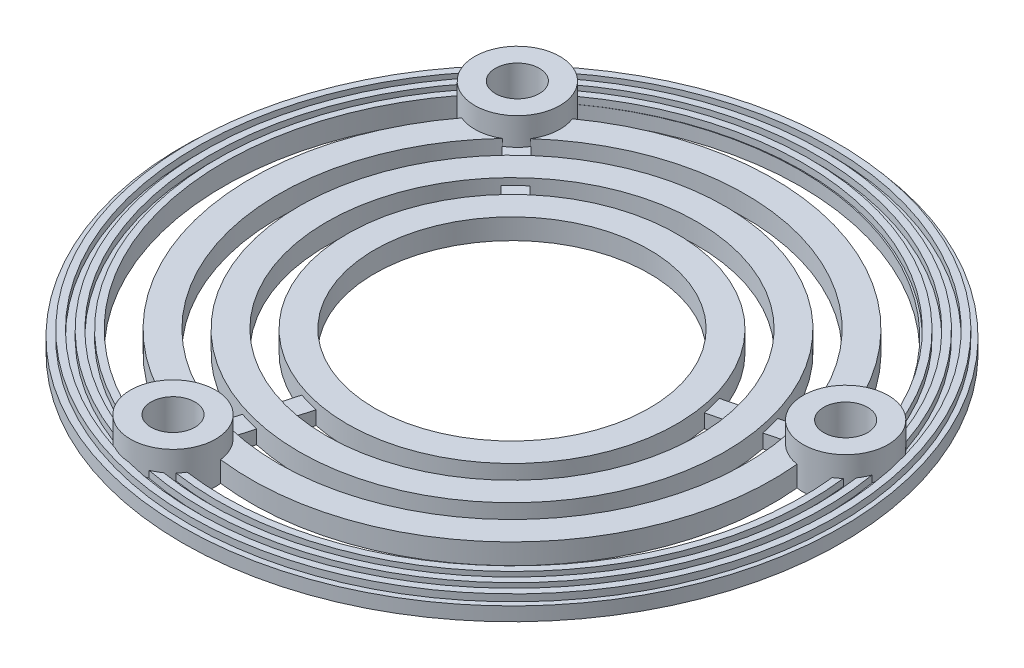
ISO-10303-21;
HEADER;
FILE_DESCRIPTION(('STEP AP214'),'2;1');
FILE_NAME('part.step','',(''),(''),'','','');
FILE_SCHEMA(('AUTOMOTIVE_DESIGN { 1 0 10303 214 1 1 1 1 }'));
ENDSEC;
DATA;
#1=APPLICATION_CONTEXT('core data for automotive mechanical design processes');
#2=APPLICATION_PROTOCOL_DEFINITION('international standard','automotive_design',2000,#1);
#3=PRODUCT_CONTEXT('',#1,'mechanical');
#4=PRODUCT('Part','Part','',(#3));
#5=PRODUCT_RELATED_PRODUCT_CATEGORY('part','',(#4));
#6=PRODUCT_DEFINITION_FORMATION('','',#4);
#7=PRODUCT_DEFINITION_CONTEXT('part definition',#1,'design');
#8=PRODUCT_DEFINITION('design','',#6,#7);
#9=PRODUCT_DEFINITION_SHAPE('','',#8);
#10=(LENGTH_UNIT() NAMED_UNIT(*) SI_UNIT(.MILLI.,.METRE.));
#11=(NAMED_UNIT(*) PLANE_ANGLE_UNIT() SI_UNIT($,.RADIAN.));
#12=(NAMED_UNIT(*) SI_UNIT($,.STERADIAN.) SOLID_ANGLE_UNIT());
#13=UNCERTAINTY_MEASURE_WITH_UNIT(LENGTH_MEASURE(1.E-05),#10,'distance_accuracy_value','');
#14=(GEOMETRIC_REPRESENTATION_CONTEXT(3) GLOBAL_UNCERTAINTY_ASSIGNED_CONTEXT((#13)) GLOBAL_UNIT_ASSIGNED_CONTEXT((#10,
#11,#12)) REPRESENTATION_CONTEXT('',''));
#15=CARTESIAN_POINT('',(0.,0.,0.));
#16=DIRECTION('',(0.,0.,1.));
#17=DIRECTION('',(1.,0.,0.));
#18=AXIS2_PLACEMENT_3D('',#15,#16,#17);
#19=CARTESIAN_POINT('',(-53.0365221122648,1.,6.83006484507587));
#20=DIRECTION('',(0.,1.,0.));
#21=DIRECTION('',(0.,0.,1.));
#22=AXIS2_PLACEMENT_3D('',#19,#20,#21);
#23=PLANE('',#22);
#24=CARTESIAN_POINT('',(0.,1.,6.83006484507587));
#25=DIRECTION('',(0.,1.,0.));
#26=DIRECTION('',(0.,0.,1.));
#27=AXIS2_PLACEMENT_3D('',#24,#25,#26);
#28=CIRCLE('',#27,21.0639548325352);
#29=CARTESIAN_POINT('',(-14.191461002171,1.,22.3958166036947));
#30=VERTEX_POINT('',#29);
#31=CARTESIAN_POINT('',(-8.63691899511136,1.,26.0418795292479));
#32=VERTEX_POINT('',#31);
#33=EDGE_CURVE('E688',#30,#32,#28,.T.);
#34=ORIENTED_EDGE('',*,*,#33,.T.);
#35=CARTESIAN_POINT('',(-5.5371007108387,1.,26.0754444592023));
#36=DIRECTION('',(0.,1.,0.));
#37=DIRECTION('',(0.,0.,1.));
#38=AXIS2_PLACEMENT_3D('',#35,#36,#37);
#39=CIRCLE('',#38,3.10000000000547);
#40=CARTESIAN_POINT('',(-8.63650255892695,1.,26.0145495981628));
#41=VERTEX_POINT('',#40);
#42=EDGE_CURVE('E566',#32,#41,#39,.F.);
#43=ORIENTED_EDGE('',*,*,#42,.T.);
#44=CARTESIAN_POINT('',(-0.0951007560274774,1.,6.83006484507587));
#45=DIRECTION('',(0.,1.,0.));
#46=DIRECTION('',(0.,0.,1.));
#47=AXIS2_PLACEMENT_3D('',#44,#45,#46);
#48=CIRCLE('',#47,21.);
#49=EDGE_CURVE('E564',#30,#41,#48,.T.);
#50=ORIENTED_EDGE('',*,*,#49,.F.);
#51=EDGE_LOOP('',(#34,#43,#50));
#52=FACE_BOUND('',#51,.T.);
#53=ADVANCED_FACE('F107',(#52),#23,.T.);
#54=CARTESIAN_POINT('',(-2.8647598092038,1.,27.6466204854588));
#55=VERTEX_POINT('',#54);
#56=CARTESIAN_POINT('',(20.7898513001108,1.,4.63489341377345));
#57=VERTEX_POINT('',#56);
#58=EDGE_CURVE('E1004',#55,#57,#48,.T.);
#59=ORIENTED_EDGE('',*,*,#58,.F.);
#60=CARTESIAN_POINT('',(-2.89340196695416,1.,27.6943505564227));
#61=VERTEX_POINT('',#60);
#62=EDGE_CURVE('E926',#55,#61,#39,.F.);
#63=ORIENTED_EDGE('',*,*,#62,.T.);
#64=CARTESIAN_POINT('',(20.9398198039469,1.,4.54661575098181));
#65=VERTEX_POINT('',#64);
#66=EDGE_CURVE('E691',#61,#65,#28,.T.);
#67=ORIENTED_EDGE('',*,*,#66,.T.);
#68=CARTESIAN_POINT('',(19.2928868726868,1.,1.92028524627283));
#69=DIRECTION('',(0.,1.,0.));
#70=DIRECTION('',(0.,0.,1.));
#71=AXIS2_PLACEMENT_3D('',#68,#69,#70);
#72=CIRCLE('',#71,3.10000000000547);
#73=EDGE_CURVE('E905',#65,#57,#72,.F.);
#74=ORIENTED_EDGE('',*,*,#73,.T.);
#75=EDGE_LOOP('',(#59,#63,#67,#74));
#76=FACE_BOUND('',#75,.T.);
#77=ADVANCED_FACE('F1011',(#76),#23,.T.);
#78=CARTESIAN_POINT('',(0.,1.,6.83006484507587));
#79=DIRECTION('',(0.,1.,0.));
#80=DIRECTION('',(0.,0.,1.));
#81=AXIS2_PLACEMENT_3D('',#78,#79,#80);
#82=CIRCLE('',#81,23.0639548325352);
#83=CARTESIAN_POINT('',(-7.01124375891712,1.,28.8025128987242));
#84=VERTEX_POINT('',#83);
#85=CARTESIAN_POINT('',(-16.7329793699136,1.,-9.04297562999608));
#86=VERTEX_POINT('',#85);
#87=EDGE_CURVE('E1062',#84,#86,#82,.F.);
#88=ORIENTED_EDGE('',*,*,#87,.F.);
#89=CARTESIAN_POINT('',(-5.5371007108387,1.,26.0754444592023));
#90=DIRECTION('',(0.,1.,0.));
#91=DIRECTION('',(0.,0.,1.));
#92=AXIS2_PLACEMENT_3D('',#89,#90,#91);
#93=CIRCLE('',#92,3.10000000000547);
#94=CARTESIAN_POINT('',(-8.031338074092,1.,27.9163083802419));
#95=VERTEX_POINT('',#94);
#96=EDGE_CURVE('E961',#84,#95,#93,.F.);
#97=ORIENTED_EDGE('',*,*,#96,.T.);
#98=CARTESIAN_POINT('',(0.,1.,6.83006484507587));
#99=DIRECTION('',(0.,1.,0.));
#100=DIRECTION('',(0.,0.,1.));
#101=AXIS2_PLACEMENT_3D('',#98,#99,#100);
#102=CIRCLE('',#101,22.5639548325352);
#103=CARTESIAN_POINT('',(-17.1197761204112,1.,-7.86841545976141));
#104=VERTEX_POINT('',#103);
#105=EDGE_CURVE('E704',#104,#95,#102,.T.);
#106=ORIENTED_EDGE('',*,*,#105,.F.);
#107=CARTESIAN_POINT('',(-14.0410884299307,1.,-7.50553517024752));
#108=DIRECTION('',(0.,1.,0.));
#109=DIRECTION('',(0.,0.,1.));
#110=AXIS2_PLACEMENT_3D('',#107,#108,#109);
#111=CIRCLE('',#110,3.10000000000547);
#112=EDGE_CURVE('E810',#104,#86,#111,.F.);
#113=ORIENTED_EDGE('',*,*,#112,.T.);
#114=EDGE_LOOP('',(#88,#97,#106,#113));
#115=FACE_BOUND('',#114,.T.);
#116=ADVANCED_FACE('F1081',(#115),#23,.T.);
#117=CARTESIAN_POINT('',(-4.40251986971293,1.,28.9603580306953));
#118=VERTEX_POINT('',#117);
#119=CARTESIAN_POINT('',(22.2241745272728,1.,2.92902341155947));
#120=VERTEX_POINT('',#119);
#121=EDGE_CURVE('E708',#118,#120,#102,.T.);
#122=ORIENTED_EDGE('',*,*,#121,.F.);
#123=CARTESIAN_POINT('',(-5.73759989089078,1.,29.1689538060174));
#124=VERTEX_POINT('',#123);
#125=EDGE_CURVE('E962',#118,#124,#93,.F.);
#126=ORIENTED_EDGE('',*,*,#125,.T.);
#127=CARTESIAN_POINT('',(-15.5223273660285,1.,-10.2287559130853));
#128=VERTEX_POINT('',#127);
#129=EDGE_CURVE('E1066',#128,#124,#82,.F.);
#130=ORIENTED_EDGE('',*,*,#129,.F.);
#131=CARTESIAN_POINT('',(-14.339992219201,1.,-10.5910912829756));
#132=VERTEX_POINT('',#131);
#133=EDGE_CURVE('E811',#128,#132,#111,.F.);
#134=ORIENTED_EDGE('',*,*,#133,.T.);
#135=CARTESIAN_POINT('',(21.3853959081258,1.,-0.366941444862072));
#136=VERTEX_POINT('',#135);
#137=EDGE_CURVE('E709',#136,#132,#102,.T.);
#138=ORIENTED_EDGE('',*,*,#137,.F.);
#139=CARTESIAN_POINT('',(19.2928868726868,1.,1.92028524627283));
#140=DIRECTION('',(0.,1.,0.));
#141=DIRECTION('',(0.,0.,1.));
#142=AXIS2_PLACEMENT_3D('',#139,#140,#141);
#143=CIRCLE('',#142,3.10000000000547);
#144=EDGE_CURVE('E881',#136,#120,#143,.F.);
#145=ORIENTED_EDGE('',*,*,#144,.T.);
#146=EDGE_LOOP('',(#122,#126,#130,#134,#138,#145));
#147=FACE_BOUND('',#146,.T.);
#148=ADVANCED_FACE('F1735',(#147),#23,.T.);
#149=CARTESIAN_POINT('',(0.,1.,6.83006484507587));
#150=DIRECTION('',(0.,1.,0.));
#151=DIRECTION('',(0.,0.,1.));
#152=AXIS2_PLACEMENT_3D('',#149,#150,#151);
#153=CIRCLE('',#152,22.0639548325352);
#154=CARTESIAN_POINT('',(-8.41567759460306,1.,27.2260074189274));
#155=VERTEX_POINT('',#154);
#156=CARTESIAN_POINT('',(-17.1139040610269,1.,-7.09589618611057));
#157=VERTEX_POINT('',#156);
#158=EDGE_CURVE('E1059',#155,#157,#153,.F.);
#159=ORIENTED_EDGE('',*,*,#158,.F.);
#160=CARTESIAN_POINT('',(-5.5371007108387,1.,26.0754444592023));
#161=DIRECTION('',(0.,1.,0.));
#162=DIRECTION('',(0.,0.,1.));
#163=AXIS2_PLACEMENT_3D('',#160,#161,#162);
#164=CIRCLE('',#163,3.10000000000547);
#165=CARTESIAN_POINT('',(-8.5908613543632,1.,26.6088729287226));
#166=VERTEX_POINT('',#165);
#167=EDGE_CURVE('E943',#155,#166,#164,.F.);
#168=ORIENTED_EDGE('',*,*,#167,.T.);
#169=CARTESIAN_POINT('',(0.,1.,6.83006484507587));
#170=DIRECTION('',(0.,1.,0.));
#171=DIRECTION('',(0.,0.,1.));
#172=AXIS2_PLACEMENT_3D('',#169,#170,#171);
#173=CIRCLE('',#172,21.5639548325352);
#174=CARTESIAN_POINT('',(-16.966385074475,1.,-6.47955293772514));
#175=VERTEX_POINT('',#174);
#176=EDGE_CURVE('E682',#175,#166,#173,.T.);
#177=ORIENTED_EDGE('',*,*,#176,.F.);
#178=CARTESIAN_POINT('',(-14.0410884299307,1.,-7.50553517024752));
#179=DIRECTION('',(0.,1.,0.));
#180=DIRECTION('',(0.,0.,1.));
#181=AXIS2_PLACEMENT_3D('',#178,#179,#180);
#182=CIRCLE('',#181,3.10000000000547);
#183=EDGE_CURVE('E791',#175,#157,#182,.F.);
#184=ORIENTED_EDGE('',*,*,#183,.T.);
#185=EDGE_LOOP('',(#159,#168,#177,#184));
#186=FACE_BOUND('',#185,.T.);
#187=ADVANCED_FACE('F1099',(#186),#23,.T.);
#188=CARTESIAN_POINT('',(-3.23373524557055,1.,28.1501751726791));
#189=VERTEX_POINT('',#188);
#190=CARTESIAN_POINT('',(21.4020055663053,1.,4.19220477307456));
#191=VERTEX_POINT('',#190);
#192=EDGE_CURVE('E686',#189,#191,#173,.T.);
#193=ORIENTED_EDGE('',*,*,#192,.F.);
#194=CARTESIAN_POINT('',(-3.71009799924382,1.,28.5798527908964));
#195=VERTEX_POINT('',#194);
#196=EDGE_CURVE('E944',#189,#195,#164,.F.);
#197=ORIENTED_EDGE('',*,*,#196,.T.);
#198=CARTESIAN_POINT('',(21.8391524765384,1.,3.68848531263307));
#199=VERTEX_POINT('',#198);
#200=EDGE_CURVE('E1056',#199,#195,#153,.F.);
#201=ORIENTED_EDGE('',*,*,#200,.F.);
#202=CARTESIAN_POINT('',(19.2928868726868,1.,1.92028524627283));
#203=DIRECTION('',(0.,1.,0.));
#204=DIRECTION('',(0.,0.,1.));
#205=AXIS2_PLACEMENT_3D('',#202,#203,#204);
#206=CIRCLE('',#205,3.10000000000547);
#207=EDGE_CURVE('E893',#199,#191,#206,.F.);
#208=ORIENTED_EDGE('',*,*,#207,.T.);
#209=EDGE_LOOP('',(#193,#197,#201,#208));
#210=FACE_BOUND('',#209,.T.);
#211=ADVANCED_FACE('F1054',(#210),#23,.T.);
#212=CARTESIAN_POINT('',(-0.0951007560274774,1.,6.83006484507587));
#213=DIRECTION('',(0.,-1.,0.));
#214=DIRECTION('',(0.,0.,-1.));
#215=AXIS2_PLACEMENT_3D('',#212,#213,#214);
#216=CYLINDRICAL_SURFACE('',#215,17.);
#217=CARTESIAN_POINT('',(-0.0951007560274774,1.5,6.83006484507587));
#218=DIRECTION('',(0.,1.,0.));
#219=DIRECTION('',(0.,0.,1.));
#220=AXIS2_PLACEMENT_3D('',#217,#218,#219);
#221=CIRCLE('',#220,17.);
#222=CARTESIAN_POINT('',(-12.4545720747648,1.5,-4.84227291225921));
#223=VERTEX_POINT('',#222);
#224=CARTESIAN_POINT('',(-5.40939626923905,1.5,22.9780759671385));
#225=VERTEX_POINT('',#224);
#226=EDGE_CURVE('E767',#223,#225,#221,.T.);
#227=ORIENTED_EDGE('',*,*,#226,.T.);
#228=DIRECTION('',(0.,-1.,0.));
#229=VECTOR('',#228,1.);
#230=CARTESIAN_POINT('',(-5.40939626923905,1.5,22.9780759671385));
#231=LINE('',#230,#229);
#232=CARTESIAN_POINT('',(-5.40939626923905,1.,22.9780759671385));
#233=VERTEX_POINT('',#232);
#234=EDGE_CURVE('E978',#225,#233,#231,.T.);
#235=ORIENTED_EDGE('',*,*,#234,.T.);
#236=CARTESIAN_POINT('',(-0.0951007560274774,1.,6.83006484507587));
#237=DIRECTION('',(0.,1.,0.));
#238=DIRECTION('',(0.,0.,1.));
#239=AXIS2_PLACEMENT_3D('',#236,#237,#238);
#240=CIRCLE('',#239,17.);
#241=CARTESIAN_POINT('',(-5.43799860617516,1.,22.9686348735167));
#242=VERTEX_POINT('',#241);
#243=EDGE_CURVE('E1181',#242,#233,#240,.T.);
#244=ORIENTED_EDGE('',*,*,#243,.F.);
#245=DIRECTION('',(0.,-1.,0.));
#246=VECTOR('',#245,1.);
#247=CARTESIAN_POINT('',(-5.43799860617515,1.,22.9686348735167));
#248=LINE('',#247,#246);
#249=CARTESIAN_POINT('',(-5.43799860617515,0.,22.9686348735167));
#250=VERTEX_POINT('',#249);
#251=EDGE_CURVE('E620',#250,#242,#248,.F.);
#252=ORIENTED_EDGE('',*,*,#251,.F.);
#253=CARTESIAN_POINT('',(-0.0951007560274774,0.,6.83006484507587));
#254=DIRECTION('',(0.,1.,0.));
#255=DIRECTION('',(0.,0.,1.));
#256=AXIS2_PLACEMENT_3D('',#253,#254,#255);
#257=CIRCLE('',#256,17.);
#258=CARTESIAN_POINT('',(-12.475233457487,0.,-4.82035636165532));
#259=VERTEX_POINT('',#258);
#260=EDGE_CURVE('E1124',#259,#250,#257,.T.);
#261=ORIENTED_EDGE('',*,*,#260,.F.);
#262=DIRECTION('',(0.,-1.,0.));
#263=VECTOR('',#262,1.);
#264=CARTESIAN_POINT('',(-12.475233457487,1.,-4.82035636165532));
#265=LINE('',#264,#263);
#266=CARTESIAN_POINT('',(-12.475233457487,1.,-4.82035636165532));
#267=VERTEX_POINT('',#266);
#268=EDGE_CURVE('E1063',#259,#267,#265,.F.);
#269=ORIENTED_EDGE('',*,*,#268,.T.);
#270=CARTESIAN_POINT('',(-12.4545720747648,1.,-4.84227291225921));
#271=VERTEX_POINT('',#270);
#272=EDGE_CURVE('E1173',#271,#267,#240,.T.);
#273=ORIENTED_EDGE('',*,*,#272,.F.);
#274=DIRECTION('',(0.,-1.,0.));
#275=VECTOR('',#274,1.);
#276=CARTESIAN_POINT('',(-12.4545720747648,1.5,-4.84227291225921));
#277=LINE('',#276,#275);
#278=EDGE_CURVE('E830',#271,#223,#277,.F.);
#279=ORIENTED_EDGE('',*,*,#278,.T.);
#280=EDGE_LOOP('',(#227,#235,#244,#252,#261,#269,#273,#279));
#281=FACE_BOUND('',#280,.T.);
#282=ADVANCED_FACE('F1177',(#281),#216,.F.);
#283=CARTESIAN_POINT('',(-4.02390611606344,1.,23.369849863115));
#284=VERTEX_POINT('',#283);
#285=CARTESIAN_POINT('',(-3.99459513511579,1.,23.3767848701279));
#286=VERTEX_POINT('',#285);
#287=EDGE_CURVE('E760',#284,#286,#240,.T.);
#288=ORIENTED_EDGE('',*,*,#287,.F.);
#289=DIRECTION('',(0.,-1.,0.));
#290=VECTOR('',#289,1.);
#291=CARTESIAN_POINT('',(-4.02390611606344,1.5,23.369849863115));
#292=LINE('',#291,#290);
#293=CARTESIAN_POINT('',(-4.02390611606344,1.5,23.369849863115));
#294=VERTEX_POINT('',#293);
#295=EDGE_CURVE('E129',#284,#294,#292,.F.);
#296=ORIENTED_EDGE('',*,*,#295,.T.);
#297=CARTESIAN_POINT('',(16.5466348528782,1.5,3.35837420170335));
#298=VERTEX_POINT('',#297);
#299=EDGE_CURVE('E770',#294,#298,#221,.T.);
#300=ORIENTED_EDGE('',*,*,#299,.T.);
#301=DIRECTION('',(0.,-1.,0.));
#302=VECTOR('',#301,1.);
#303=CARTESIAN_POINT('',(16.5466348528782,1.5,3.35837420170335));
#304=LINE('',#303,#302);
#305=CARTESIAN_POINT('',(16.5466348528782,1.,3.35837420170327));
#306=VERTEX_POINT('',#305);
#307=EDGE_CURVE('E855',#298,#306,#304,.T.);
#308=ORIENTED_EDGE('',*,*,#307,.T.);
#309=CARTESIAN_POINT('',(16.5527597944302,1.,3.38786509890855));
#310=VERTEX_POINT('',#309);
#311=EDGE_CURVE('E755',#310,#306,#240,.T.);
#312=ORIENTED_EDGE('',*,*,#311,.F.);
#313=DIRECTION('',(0.,-1.,0.));
#314=VECTOR('',#313,1.);
#315=CARTESIAN_POINT('',(16.5527597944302,1.,3.38786509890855));
#316=LINE('',#315,#314);
#317=CARTESIAN_POINT('',(16.5527597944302,0.,3.38786509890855));
#318=VERTEX_POINT('',#317);
#319=EDGE_CURVE('E656',#318,#310,#316,.F.);
#320=ORIENTED_EDGE('',*,*,#319,.F.);
#321=CARTESIAN_POINT('',(-3.99459513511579,0.,23.3767848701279));
#322=VERTEX_POINT('',#321);
#323=EDGE_CURVE('E1130',#322,#318,#257,.T.);
#324=ORIENTED_EDGE('',*,*,#323,.F.);
#325=DIRECTION('',(0.,-1.,0.));
#326=VECTOR('',#325,1.);
#327=CARTESIAN_POINT('',(-3.99459513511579,1.,23.3767848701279));
#328=LINE('',#327,#326);
#329=EDGE_CURVE('E611',#286,#322,#328,.T.);
#330=ORIENTED_EDGE('',*,*,#329,.F.);
#331=EDGE_LOOP('',(#288,#296,#300,#308,#312,#320,#324,#330));
#332=FACE_BOUND('',#331,.T.);
#333=ADVANCED_FACE('F1161',(#332),#216,.F.);
#334=CARTESIAN_POINT('',(-0.0951007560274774,1.,6.83006484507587));
#335=DIRECTION('',(0.,-1.,0.));
#336=DIRECTION('',(0.,0.,-1.));
#337=AXIS2_PLACEMENT_3D('',#334,#335,#336);
#338=CYLINDRICAL_SURFACE('',#337,19.);
#339=DIRECTION('',(0.,-1.,0.));
#340=VECTOR('',#339,1.);
#341=CARTESIAN_POINT('',(-7.95069806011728,1.5,24.1300530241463));
#342=LINE('',#341,#340);
#343=CARTESIAN_POINT('',(-7.95069806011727,1.5,24.1300530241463));
#344=VERTEX_POINT('',#343);
#345=CARTESIAN_POINT('',(-7.95069806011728,0.,24.1300530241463));
#346=VERTEX_POINT('',#345);
#347=EDGE_CURVE('E548',#344,#346,#342,.T.);
#348=ORIENTED_EDGE('',*,*,#347,.F.);
#349=CARTESIAN_POINT('',(-0.0951007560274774,1.5,6.83006484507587));
#350=DIRECTION('',(0.,1.,0.));
#351=DIRECTION('',(0.,0.,1.));
#352=AXIS2_PLACEMENT_3D('',#349,#350,#351);
#353=CIRCLE('',#352,19.);
#354=CARTESIAN_POINT('',(-15.2378593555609,1.5,-4.6458604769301));
#355=VERTEX_POINT('',#354);
#356=EDGE_CURVE('E762',#355,#344,#353,.T.);
#357=ORIENTED_EDGE('',*,*,#356,.F.);
#358=DIRECTION('',(0.,-1.,0.));
#359=VECTOR('',#358,1.);
#360=CARTESIAN_POINT('',(-15.2378593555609,1.5,-4.64586047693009));
#361=LINE('',#360,#359);
#362=CARTESIAN_POINT('',(-15.2378593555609,0.,-4.64586047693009));
#363=VERTEX_POINT('',#362);
#364=EDGE_CURVE('E832',#363,#355,#361,.F.);
#365=ORIENTED_EDGE('',*,*,#364,.F.);
#366=CARTESIAN_POINT('',(-0.0951007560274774,0.,6.83006484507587));
#367=DIRECTION('',(0.,1.,0.));
#368=DIRECTION('',(0.,0.,1.));
#369=AXIS2_PLACEMENT_3D('',#366,#367,#368);
#370=CIRCLE('',#369,19.);
#371=EDGE_CURVE('E1116',#363,#346,#370,.T.);
#372=ORIENTED_EDGE('',*,*,#371,.T.);
#373=EDGE_LOOP('',(#348,#357,#365,#372));
#374=FACE_BOUND('',#373,.T.);
#375=ADVANCED_FACE('F1115',(#374),#338,.T.);
#376=DIRECTION('',(0.,-1.,0.));
#377=VECTOR('',#376,1.);
#378=CARTESIAN_POINT('',(-2.46216431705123,1.5,25.68204113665));
#379=LINE('',#378,#377);
#380=CARTESIAN_POINT('',(-2.46216431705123,0.,25.68204113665));
#381=VERTEX_POINT('',#380);
#382=CARTESIAN_POINT('',(-2.46216431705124,1.5,25.68204113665));
#383=VERTEX_POINT('',#382);
#384=EDGE_CURVE('E972',#381,#383,#379,.F.);
#385=ORIENTED_EDGE('',*,*,#384,.F.);
#386=CARTESIAN_POINT('',(18.8149271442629,0.,4.98321758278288));
#387=VERTEX_POINT('',#386);
#388=EDGE_CURVE('E998',#381,#387,#370,.T.);
#389=ORIENTED_EDGE('',*,*,#388,.T.);
#390=DIRECTION('',(0.,-1.,0.));
#391=VECTOR('',#390,1.);
#392=CARTESIAN_POINT('',(18.8149271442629,1.5,4.98321758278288));
#393=LINE('',#392,#391);
#394=CARTESIAN_POINT('',(18.8149271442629,1.5,4.98321758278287));
#395=VERTEX_POINT('',#394);
#396=EDGE_CURVE('E845',#395,#387,#393,.T.);
#397=ORIENTED_EDGE('',*,*,#396,.F.);
#398=EDGE_CURVE('E765',#383,#395,#353,.T.);
#399=ORIENTED_EDGE('',*,*,#398,.F.);
#400=EDGE_LOOP('',(#385,#389,#397,#399));
#401=FACE_BOUND('',#400,.T.);
#402=ADVANCED_FACE('F1158',(#401),#338,.T.);
#403=CARTESIAN_POINT('',(0.,1.5,6.83006484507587));
#404=DIRECTION('',(0.,-1.,0.));
#405=DIRECTION('',(0.,0.,-1.));
#406=AXIS2_PLACEMENT_3D('',#403,#404,#405);
#407=CYLINDRICAL_SURFACE('',#406,21.0639548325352);
#408=CARTESIAN_POINT('',(0.,1.5,6.83006484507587));
#409=DIRECTION('',(0.,1.,0.));
#410=DIRECTION('',(0.,0.,1.));
#411=AXIS2_PLACEMENT_3D('',#408,#409,#410);
#412=CIRCLE('',#411,21.0639548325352);
#413=CARTESIAN_POINT('',(-14.191461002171,1.5,22.3958166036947));
#414=VERTEX_POINT('',#413);
#415=CARTESIAN_POINT('',(-8.63691899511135,1.5,26.0418795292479));
#416=VERTEX_POINT('',#415);
#417=EDGE_CURVE('E700',#414,#416,#412,.T.);
#418=ORIENTED_EDGE('',*,*,#417,.T.);
#419=DIRECTION('',(0.,-1.,0.));
#420=VECTOR('',#419,1.);
#421=CARTESIAN_POINT('',(-8.63691899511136,1.5,26.0418795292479));
#422=LINE('',#421,#420);
#423=EDGE_CURVE('E929',#416,#32,#422,.T.);
#424=ORIENTED_EDGE('',*,*,#423,.T.);
#425=ORIENTED_EDGE('',*,*,#33,.F.);
#426=DIRECTION('',(0.,-1.,0.));
#427=VECTOR('',#426,1.);
#428=CARTESIAN_POINT('',(-14.191461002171,1.5,22.3958166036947));
#429=LINE('',#428,#427);
#430=EDGE_CURVE('E679',#414,#30,#429,.T.);
#431=ORIENTED_EDGE('',*,*,#430,.F.);
#432=EDGE_LOOP('',(#418,#424,#425,#431));
#433=FACE_BOUND('',#432,.T.);
#434=ADVANCED_FACE('F1357',(#433),#407,.F.);
#435=ORIENTED_EDGE('',*,*,#66,.F.);
#436=DIRECTION('',(0.,-1.,0.));
#437=VECTOR('',#436,1.);
#438=CARTESIAN_POINT('',(-2.89340196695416,1.5,27.6943505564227));
#439=LINE('',#438,#437);
#440=CARTESIAN_POINT('',(-2.89340196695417,1.5,27.6943505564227));
#441=VERTEX_POINT('',#440);
#442=EDGE_CURVE('E932',#61,#441,#439,.F.);
#443=ORIENTED_EDGE('',*,*,#442,.T.);
#444=CARTESIAN_POINT('',(20.9398198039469,1.5,4.54661575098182));
#445=VERTEX_POINT('',#444);
#446=EDGE_CURVE('E703',#441,#445,#412,.T.);
#447=ORIENTED_EDGE('',*,*,#446,.T.);
#448=DIRECTION('',(0.,-1.,0.));
#449=VECTOR('',#448,1.);
#450=CARTESIAN_POINT('',(20.9398198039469,1.5,4.54661575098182));
#451=LINE('',#450,#449);
#452=EDGE_CURVE('E902',#445,#65,#451,.T.);
#453=ORIENTED_EDGE('',*,*,#452,.T.);
#454=EDGE_LOOP('',(#435,#443,#447,#453));
#455=FACE_BOUND('',#454,.T.);
#456=ADVANCED_FACE('F1032',(#455),#407,.F.);
#457=CARTESIAN_POINT('',(0.,1.5,6.83006484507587));
#458=DIRECTION('',(0.,-1.,0.));
#459=DIRECTION('',(0.,0.,-1.));
#460=AXIS2_PLACEMENT_3D('',#457,#458,#459);
#461=CYLINDRICAL_SURFACE('',#460,21.5639548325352);
#462=DIRECTION('',(0.,-1.,0.));
#463=VECTOR('',#462,1.);
#464=CARTESIAN_POINT('',(-8.5908613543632,1.5,26.6088729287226));
#465=LINE('',#464,#463);
#466=CARTESIAN_POINT('',(-8.5908613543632,1.5,26.6088729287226));
#467=VERTEX_POINT('',#466);
#468=EDGE_CURVE('E939',#467,#166,#465,.T.);
#469=ORIENTED_EDGE('',*,*,#468,.F.);
#470=CARTESIAN_POINT('',(0.,1.5,6.83006484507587));
#471=DIRECTION('',(0.,1.,0.));
#472=DIRECTION('',(0.,0.,1.));
#473=AXIS2_PLACEMENT_3D('',#470,#471,#472);
#474=CIRCLE('',#473,21.5639548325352);
#475=CARTESIAN_POINT('',(-16.966385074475,1.5,-6.47955293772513));
#476=VERTEX_POINT('',#475);
#477=EDGE_CURVE('E681',#476,#467,#474,.T.);
#478=ORIENTED_EDGE('',*,*,#477,.F.);
#479=DIRECTION('',(0.,-1.,0.));
#480=VECTOR('',#479,1.);
#481=CARTESIAN_POINT('',(-16.966385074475,1.5,-6.47955293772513));
#482=LINE('',#481,#480);
#483=EDGE_CURVE('E789',#175,#476,#482,.F.);
#484=ORIENTED_EDGE('',*,*,#483,.F.);
#485=ORIENTED_EDGE('',*,*,#176,.T.);
#486=EDGE_LOOP('',(#469,#478,#484,#485));
#487=FACE_BOUND('',#486,.T.);
#488=ADVANCED_FACE('F1103',(#487),#461,.T.);
#489=DIRECTION('',(0.,-1.,0.));
#490=VECTOR('',#489,1.);
#491=CARTESIAN_POINT('',(-3.23373524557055,1.5,28.1501751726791));
#492=LINE('',#491,#490);
#493=CARTESIAN_POINT('',(-3.23373524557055,1.5,28.1501751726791));
#494=VERTEX_POINT('',#493);
#495=EDGE_CURVE('E941',#189,#494,#492,.F.);
#496=ORIENTED_EDGE('',*,*,#495,.F.);
#497=ORIENTED_EDGE('',*,*,#192,.T.);
#498=DIRECTION('',(0.,-1.,0.));
#499=VECTOR('',#498,1.);
#500=CARTESIAN_POINT('',(21.4020055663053,1.5,4.19220477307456));
#501=LINE('',#500,#499);
#502=CARTESIAN_POINT('',(21.4020055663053,1.5,4.19220477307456));
#503=VERTEX_POINT('',#502);
#504=EDGE_CURVE('E896',#503,#191,#501,.T.);
#505=ORIENTED_EDGE('',*,*,#504,.F.);
#506=EDGE_CURVE('E695',#494,#503,#474,.T.);
#507=ORIENTED_EDGE('',*,*,#506,.F.);
#508=EDGE_LOOP('',(#496,#497,#505,#507));
#509=FACE_BOUND('',#508,.T.);
#510=ADVANCED_FACE('F1050',(#509),#461,.T.);
#511=CARTESIAN_POINT('',(-53.0365221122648,1.5,6.83006484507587));
#512=DIRECTION('',(0.,1.,0.));
#513=DIRECTION('',(0.,0.,1.));
#514=AXIS2_PLACEMENT_3D('',#511,#512,#513);
#515=PLANE('',#514);
#516=ORIENTED_EDGE('',*,*,#477,.T.);
#517=CARTESIAN_POINT('',(-5.5371007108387,1.5,26.0754444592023));
#518=DIRECTION('',(0.,1.,0.));
#519=DIRECTION('',(0.,0.,1.));
#520=AXIS2_PLACEMENT_3D('',#517,#518,#519);
#521=CIRCLE('',#520,3.10000000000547);
#522=EDGE_CURVE('E935',#467,#416,#521,.F.);
#523=ORIENTED_EDGE('',*,*,#522,.T.);
#524=ORIENTED_EDGE('',*,*,#417,.F.);
#525=CARTESIAN_POINT('',(-0.0951007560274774,1.5,6.83006484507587));
#526=DIRECTION('',(0.,1.,0.));
#527=DIRECTION('',(0.,0.,1.));
#528=AXIS2_PLACEMENT_3D('',#525,#526,#527);
#529=CIRCLE('',#528,21.);
#530=CARTESIAN_POINT('',(-16.7379372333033,1.5,-5.9768080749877));
#531=VERTEX_POINT('',#530);
#532=EDGE_CURVE('E697',#414,#531,#529,.F.);
#533=ORIENTED_EDGE('',*,*,#532,.T.);
#534=CARTESIAN_POINT('',(-14.0410884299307,1.5,-7.50553517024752));
#535=DIRECTION('',(0.,1.,0.));
#536=DIRECTION('',(0.,0.,1.));
#537=AXIS2_PLACEMENT_3D('',#534,#535,#536);
#538=CIRCLE('',#537,3.10000000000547);
#539=EDGE_CURVE('E782',#531,#476,#538,.F.);
#540=ORIENTED_EDGE('',*,*,#539,.T.);
#541=EDGE_LOOP('',(#516,#523,#524,#533,#540));
#542=FACE_BOUND('',#541,.T.);
#543=ADVANCED_FACE('F1107',(#542),#515,.T.);
#544=ORIENTED_EDGE('',*,*,#446,.F.);
#545=EDGE_CURVE('E936',#441,#494,#521,.F.);
#546=ORIENTED_EDGE('',*,*,#545,.T.);
#547=ORIENTED_EDGE('',*,*,#506,.T.);
#548=CARTESIAN_POINT('',(19.2928868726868,1.5,1.92028524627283));
#549=DIRECTION('',(0.,1.,0.));
#550=DIRECTION('',(0.,0.,1.));
#551=AXIS2_PLACEMENT_3D('',#548,#549,#550);
#552=CIRCLE('',#551,3.10000000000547);
#553=EDGE_CURVE('E899',#503,#445,#552,.F.);
#554=ORIENTED_EDGE('',*,*,#553,.T.);
#555=EDGE_LOOP('',(#544,#546,#547,#554));
#556=FACE_BOUND('',#555,.T.);
#557=ADVANCED_FACE('F1036',(#556),#515,.T.);
#558=CARTESIAN_POINT('',(0.,1.5,6.83006484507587));
#559=DIRECTION('',(0.,-1.,0.));
#560=DIRECTION('',(0.,0.,-1.));
#561=AXIS2_PLACEMENT_3D('',#558,#559,#560);
#562=CYLINDRICAL_SURFACE('',#561,22.0639548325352);
#563=CARTESIAN_POINT('',(0.,1.5,6.83006484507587));
#564=DIRECTION('',(0.,1.,0.));
#565=DIRECTION('',(0.,0.,1.));
#566=AXIS2_PLACEMENT_3D('',#563,#564,#565);
#567=CIRCLE('',#566,22.0639548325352);
#568=CARTESIAN_POINT('',(-17.1139040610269,1.5,-7.09589618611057));
#569=VERTEX_POINT('',#568);
#570=CARTESIAN_POINT('',(-8.41567759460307,1.5,27.2260074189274));
#571=VERTEX_POINT('',#570);
#572=EDGE_CURVE('E715',#569,#571,#567,.T.);
#573=ORIENTED_EDGE('',*,*,#572,.T.);
#574=DIRECTION('',(0.,-1.,0.));
#575=VECTOR('',#574,1.);
#576=CARTESIAN_POINT('',(-8.41567759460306,1.5,27.2260074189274));
#577=LINE('',#576,#575);
#578=EDGE_CURVE('E947',#571,#155,#577,.T.);
#579=ORIENTED_EDGE('',*,*,#578,.T.);
#580=ORIENTED_EDGE('',*,*,#158,.T.);
#581=DIRECTION('',(0.,-1.,0.));
#582=VECTOR('',#581,1.);
#583=CARTESIAN_POINT('',(-17.1139040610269,1.5,-7.09589618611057));
#584=LINE('',#583,#582);
#585=EDGE_CURVE('E798',#157,#569,#584,.F.);
#586=ORIENTED_EDGE('',*,*,#585,.T.);
#587=EDGE_LOOP('',(#573,#579,#580,#586));
#588=FACE_BOUND('',#587,.T.);
#589=ADVANCED_FACE('F1093',(#588),#562,.F.);
#590=ORIENTED_EDGE('',*,*,#200,.T.);
#591=DIRECTION('',(0.,-1.,0.));
#592=VECTOR('',#591,1.);
#593=CARTESIAN_POINT('',(-3.71009799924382,1.5,28.5798527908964));
#594=LINE('',#593,#592);
#595=CARTESIAN_POINT('',(-3.71009799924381,1.5,28.5798527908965));
#596=VERTEX_POINT('',#595);
#597=EDGE_CURVE('E950',#195,#596,#594,.F.);
#598=ORIENTED_EDGE('',*,*,#597,.T.);
#599=CARTESIAN_POINT('',(21.8391524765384,1.5,3.68848531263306));
#600=VERTEX_POINT('',#599);
#601=EDGE_CURVE('E718',#596,#600,#567,.T.);
#602=ORIENTED_EDGE('',*,*,#601,.T.);
#603=DIRECTION('',(0.,-1.,0.));
#604=VECTOR('',#603,1.);
#605=CARTESIAN_POINT('',(21.8391524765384,1.5,3.68848531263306));
#606=LINE('',#605,#604);
#607=EDGE_CURVE('E890',#600,#199,#606,.T.);
#608=ORIENTED_EDGE('',*,*,#607,.T.);
#609=EDGE_LOOP('',(#590,#598,#602,#608));
#610=FACE_BOUND('',#609,.T.);
#611=ADVANCED_FACE('F1367',(#610),#562,.F.);
#612=CARTESIAN_POINT('',(0.,1.5,6.83006484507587));
#613=DIRECTION('',(0.,-1.,0.));
#614=DIRECTION('',(0.,0.,-1.));
#615=AXIS2_PLACEMENT_3D('',#612,#613,#614);
#616=CYLINDRICAL_SURFACE('',#615,22.5639548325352);
#617=DIRECTION('',(0.,-1.,0.));
#618=VECTOR('',#617,1.);
#619=CARTESIAN_POINT('',(-8.03133807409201,1.5,27.9163083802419));
#620=LINE('',#619,#618);
#621=CARTESIAN_POINT('',(-8.03133807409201,1.5,27.9163083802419));
#622=VERTEX_POINT('',#621);
#623=EDGE_CURVE('E957',#622,#95,#620,.T.);
#624=ORIENTED_EDGE('',*,*,#623,.F.);
#625=CARTESIAN_POINT('',(0.,1.5,6.83006484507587));
#626=DIRECTION('',(0.,1.,0.));
#627=DIRECTION('',(0.,0.,1.));
#628=AXIS2_PLACEMENT_3D('',#625,#626,#627);
#629=CIRCLE('',#628,22.5639548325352);
#630=CARTESIAN_POINT('',(-17.1197761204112,1.5,-7.8684154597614));
#631=VERTEX_POINT('',#630);
#632=EDGE_CURVE('E710',#631,#622,#629,.T.);
#633=ORIENTED_EDGE('',*,*,#632,.F.);
#634=DIRECTION('',(0.,-1.,0.));
#635=VECTOR('',#634,1.);
#636=CARTESIAN_POINT('',(-17.1197761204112,1.5,-7.86841545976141));
#637=LINE('',#636,#635);
#638=EDGE_CURVE('E808',#104,#631,#637,.F.);
#639=ORIENTED_EDGE('',*,*,#638,.F.);
#640=ORIENTED_EDGE('',*,*,#105,.T.);
#641=EDGE_LOOP('',(#624,#633,#639,#640));
#642=FACE_BOUND('',#641,.T.);
#643=ADVANCED_FACE('F1084',(#642),#616,.T.);
#644=DIRECTION('',(0.,-1.,0.));
#645=VECTOR('',#644,1.);
#646=CARTESIAN_POINT('',(-4.40251986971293,1.5,28.9603580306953));
#647=LINE('',#646,#645);
#648=CARTESIAN_POINT('',(-4.40251986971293,1.5,28.9603580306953));
#649=VERTEX_POINT('',#648);
#650=EDGE_CURVE('E959',#118,#649,#647,.F.);
#651=ORIENTED_EDGE('',*,*,#650,.F.);
#652=ORIENTED_EDGE('',*,*,#121,.T.);
#653=DIRECTION('',(0.,-1.,0.));
#654=VECTOR('',#653,1.);
#655=CARTESIAN_POINT('',(22.2241745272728,1.5,2.92902341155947));
#656=LINE('',#655,#654);
#657=CARTESIAN_POINT('',(22.2241745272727,1.5,2.92902341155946));
#658=VERTEX_POINT('',#657);
#659=EDGE_CURVE('E884',#658,#120,#656,.T.);
#660=ORIENTED_EDGE('',*,*,#659,.F.);
#661=EDGE_CURVE('E713',#649,#658,#629,.T.);
#662=ORIENTED_EDGE('',*,*,#661,.F.);
#663=EDGE_LOOP('',(#651,#652,#660,#662));
#664=FACE_BOUND('',#663,.T.);
#665=ADVANCED_FACE('F1370',(#664),#616,.T.);
#666=CARTESIAN_POINT('',(-53.0365221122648,1.5,6.83006484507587));
#667=DIRECTION('',(0.,1.,0.));
#668=DIRECTION('',(0.,0.,1.));
#669=AXIS2_PLACEMENT_3D('',#666,#667,#668);
#670=PLANE('',#669);
#671=ORIENTED_EDGE('',*,*,#632,.T.);
#672=CARTESIAN_POINT('',(-5.5371007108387,1.5,26.0754444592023));
#673=DIRECTION('',(0.,1.,0.));
#674=DIRECTION('',(0.,0.,1.));
#675=AXIS2_PLACEMENT_3D('',#672,#673,#674);
#676=CIRCLE('',#675,3.10000000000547);
#677=EDGE_CURVE('E953',#622,#571,#676,.F.);
#678=ORIENTED_EDGE('',*,*,#677,.T.);
#679=ORIENTED_EDGE('',*,*,#572,.F.);
#680=CARTESIAN_POINT('',(-14.0410884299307,1.5,-7.50553517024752));
#681=DIRECTION('',(0.,1.,0.));
#682=DIRECTION('',(0.,0.,1.));
#683=AXIS2_PLACEMENT_3D('',#680,#681,#682);
#684=CIRCLE('',#683,3.10000000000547);
#685=EDGE_CURVE('E801',#569,#631,#684,.F.);
#686=ORIENTED_EDGE('',*,*,#685,.T.);
#687=EDGE_LOOP('',(#671,#678,#679,#686));
#688=FACE_BOUND('',#687,.T.);
#689=ADVANCED_FACE('F1090',(#688),#670,.T.);
#690=ORIENTED_EDGE('',*,*,#601,.F.);
#691=EDGE_CURVE('E954',#596,#649,#676,.F.);
#692=ORIENTED_EDGE('',*,*,#691,.T.);
#693=ORIENTED_EDGE('',*,*,#661,.T.);
#694=CARTESIAN_POINT('',(19.2928868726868,1.5,1.92028524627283));
#695=DIRECTION('',(0.,1.,0.));
#696=DIRECTION('',(0.,0.,1.));
#697=AXIS2_PLACEMENT_3D('',#694,#695,#696);
#698=CIRCLE('',#697,3.10000000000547);
#699=EDGE_CURVE('E887',#658,#600,#698,.F.);
#700=ORIENTED_EDGE('',*,*,#699,.T.);
#701=EDGE_LOOP('',(#690,#692,#693,#700));
#702=FACE_BOUND('',#701,.T.);
#703=ADVANCED_FACE('F1263',(#702),#670,.T.);
#704=CARTESIAN_POINT('',(-44.427778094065,1.5,6.83006484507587));
#705=DIRECTION('',(0.,1.,0.));
#706=DIRECTION('',(0.,0.,1.));
#707=AXIS2_PLACEMENT_3D('',#704,#705,#706);
#708=PLANE('',#707);
#709=ORIENTED_EDGE('',*,*,#356,.T.);
#710=CARTESIAN_POINT('',(-5.5371007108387,1.5,26.0754444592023));
#711=DIRECTION('',(0.,1.,0.));
#712=DIRECTION('',(0.,0.,1.));
#713=AXIS2_PLACEMENT_3D('',#710,#711,#712);
#714=CIRCLE('',#713,3.10000000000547);
#715=EDGE_CURVE('E974',#344,#225,#714,.F.);
#716=ORIENTED_EDGE('',*,*,#715,.T.);
#717=ORIENTED_EDGE('',*,*,#226,.F.);
#718=CARTESIAN_POINT('',(-14.0410884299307,1.5,-7.50553517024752));
#719=DIRECTION('',(0.,1.,0.));
#720=DIRECTION('',(0.,0.,1.));
#721=AXIS2_PLACEMENT_3D('',#718,#719,#720);
#722=CIRCLE('',#721,3.10000000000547);
#723=EDGE_CURVE('E111',#223,#355,#722,.F.);
#724=ORIENTED_EDGE('',*,*,#723,.T.);
#725=EDGE_LOOP('',(#709,#716,#717,#724));
#726=FACE_BOUND('',#725,.T.);
#727=ADVANCED_FACE('F1261',(#726),#708,.T.);
#728=ORIENTED_EDGE('',*,*,#299,.F.);
#729=EDGE_CURVE('E975',#294,#383,#714,.F.);
#730=ORIENTED_EDGE('',*,*,#729,.T.);
#731=ORIENTED_EDGE('',*,*,#398,.T.);
#732=CARTESIAN_POINT('',(19.2928868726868,1.5,1.92028524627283));
#733=DIRECTION('',(0.,1.,0.));
#734=DIRECTION('',(0.,0.,1.));
#735=AXIS2_PLACEMENT_3D('',#732,#733,#734);
#736=CIRCLE('',#735,3.10000000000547);
#737=EDGE_CURVE('E851',#395,#298,#736,.F.);
#738=ORIENTED_EDGE('',*,*,#737,.T.);
#739=EDGE_LOOP('',(#728,#730,#731,#738));
#740=FACE_BOUND('',#739,.T.);
#741=ADVANCED_FACE('F1154',(#740),#708,.T.);
#742=CARTESIAN_POINT('',(-0.0951007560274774,1.,6.83006484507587));
#743=DIRECTION('',(0.,-1.,0.));
#744=DIRECTION('',(0.,0.,-1.));
#745=AXIS2_PLACEMENT_3D('',#742,#743,#744);
#746=CYLINDRICAL_SURFACE('',#745,21.);
#747=CARTESIAN_POINT('',(-0.0951007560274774,0.,6.83006484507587));
#748=DIRECTION('',(0.,1.,0.));
#749=DIRECTION('',(0.,0.,1.));
#750=AXIS2_PLACEMENT_3D('',#747,#748,#749);
#751=CIRCLE('',#750,21.);
#752=CARTESIAN_POINT('',(-2.8647598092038,0.,27.6466204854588));
#753=VERTEX_POINT('',#752);
#754=CARTESIAN_POINT('',(20.7898513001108,0.,4.63489341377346));
#755=VERTEX_POINT('',#754);
#756=EDGE_CURVE('E574',#753,#755,#751,.T.);
#757=ORIENTED_EDGE('',*,*,#756,.F.);
#758=DIRECTION('',(0.,-1.,0.));
#759=VECTOR('',#758,1.);
#760=CARTESIAN_POINT('',(-2.8647598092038,1.5,27.6466204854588));
#761=LINE('',#760,#759);
#762=EDGE_CURVE('E565',#753,#55,#761,.F.);
#763=ORIENTED_EDGE('',*,*,#762,.T.);
#764=ORIENTED_EDGE('',*,*,#58,.T.);
#765=DIRECTION('',(0.,-1.,0.));
#766=VECTOR('',#765,1.);
#767=CARTESIAN_POINT('',(20.7898513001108,1.5,4.63489341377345));
#768=LINE('',#767,#766);
#769=EDGE_CURVE('E908',#57,#755,#768,.T.);
#770=ORIENTED_EDGE('',*,*,#769,.T.);
#771=EDGE_LOOP('',(#757,#763,#764,#770));
#772=FACE_BOUND('',#771,.T.);
#773=ADVANCED_FACE('F1001',(#772),#746,.F.);
#774=ORIENTED_EDGE('',*,*,#49,.T.);
#775=DIRECTION('',(0.,-1.,0.));
#776=VECTOR('',#775,1.);
#777=CARTESIAN_POINT('',(-8.63650255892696,1.5,26.0145495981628));
#778=LINE('',#777,#776);
#779=CARTESIAN_POINT('',(-8.63650255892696,0.,26.0145495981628));
#780=VERTEX_POINT('',#779);
#781=EDGE_CURVE('E545',#41,#780,#778,.T.);
#782=ORIENTED_EDGE('',*,*,#781,.T.);
#783=CARTESIAN_POINT('',(-16.7379372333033,0.,-5.9768080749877));
#784=VERTEX_POINT('',#783);
#785=EDGE_CURVE('E561',#784,#780,#751,.T.);
#786=ORIENTED_EDGE('',*,*,#785,.F.);
#787=DIRECTION('',(0.,-1.,0.));
#788=VECTOR('',#787,1.);
#789=CARTESIAN_POINT('',(-16.7379372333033,1.5,-5.9768080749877));
#790=LINE('',#789,#788);
#791=EDGE_CURVE('E777',#784,#531,#790,.F.);
#792=ORIENTED_EDGE('',*,*,#791,.T.);
#793=ORIENTED_EDGE('',*,*,#532,.F.);
#794=ORIENTED_EDGE('',*,*,#430,.T.);
#795=EDGE_LOOP('',(#774,#782,#786,#792,#793,#794));
#796=FACE_BOUND('',#795,.T.);
#797=ADVANCED_FACE('F559',(#796),#746,.F.);
#798=CARTESIAN_POINT('',(0.,1.5,6.83006484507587));
#799=DIRECTION('',(0.,-1.,0.));
#800=DIRECTION('',(0.,0.,-1.));
#801=AXIS2_PLACEMENT_3D('',#798,#799,#800);
#802=CYLINDRICAL_SURFACE('',#801,23.0639548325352);
#803=CARTESIAN_POINT('',(0.,1.5,6.83006484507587));
#804=DIRECTION('',(0.,1.,0.));
#805=DIRECTION('',(0.,0.,1.));
#806=AXIS2_PLACEMENT_3D('',#803,#804,#805);
#807=CIRCLE('',#806,23.0639548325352);
#808=CARTESIAN_POINT('',(-16.7329793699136,1.5,-9.04297562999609));
#809=VERTEX_POINT('',#808);
#810=CARTESIAN_POINT('',(-7.01124375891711,1.5,28.8025128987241));
#811=VERTEX_POINT('',#810);
#812=EDGE_CURVE('E727',#809,#811,#807,.T.);
#813=ORIENTED_EDGE('',*,*,#812,.T.);
#814=DIRECTION('',(0.,-1.,0.));
#815=VECTOR('',#814,1.);
#816=CARTESIAN_POINT('',(-7.01124375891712,1.5,28.8025128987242));
#817=LINE('',#816,#815);
#818=EDGE_CURVE('E122',#811,#84,#817,.T.);
#819=ORIENTED_EDGE('',*,*,#818,.T.);
#820=ORIENTED_EDGE('',*,*,#87,.T.);
#821=DIRECTION('',(0.,-1.,0.));
#822=VECTOR('',#821,1.);
#823=CARTESIAN_POINT('',(-16.7329793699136,1.5,-9.0429756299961));
#824=LINE('',#823,#822);
#825=EDGE_CURVE('E817',#86,#809,#824,.F.);
#826=ORIENTED_EDGE('',*,*,#825,.T.);
#827=EDGE_LOOP('',(#813,#819,#820,#826));
#828=FACE_BOUND('',#827,.T.);
#829=ADVANCED_FACE('F1073',(#828),#802,.F.);
#830=ORIENTED_EDGE('',*,*,#129,.T.);
#831=DIRECTION('',(0.,-1.,0.));
#832=VECTOR('',#831,1.);
#833=CARTESIAN_POINT('',(-5.73759989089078,1.5,29.1689538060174));
#834=LINE('',#833,#832);
#835=CARTESIAN_POINT('',(-5.73759989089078,1.5,29.1689538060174));
#836=VERTEX_POINT('',#835);
#837=EDGE_CURVE('E966',#124,#836,#834,.F.);
#838=ORIENTED_EDGE('',*,*,#837,.T.);
#839=CARTESIAN_POINT('',(-15.5223273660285,1.5,-10.2287559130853));
#840=VERTEX_POINT('',#839);
#841=EDGE_CURVE('E722',#836,#840,#807,.T.);
#842=ORIENTED_EDGE('',*,*,#841,.T.);
#843=DIRECTION('',(0.,-1.,0.));
#844=VECTOR('',#843,1.);
#845=CARTESIAN_POINT('',(-15.5223273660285,1.5,-10.2287559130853));
#846=LINE('',#845,#844);
#847=EDGE_CURVE('E814',#840,#128,#846,.T.);
#848=ORIENTED_EDGE('',*,*,#847,.T.);
#849=EDGE_LOOP('',(#830,#838,#842,#848));
#850=FACE_BOUND('',#849,.T.);
#851=ADVANCED_FACE('F1377',(#850),#802,.F.);
#852=CARTESIAN_POINT('',(-53.0365221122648,1.5,6.83006484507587));
#853=DIRECTION('',(0.,1.,0.));
#854=DIRECTION('',(0.,0.,1.));
#855=AXIS2_PLACEMENT_3D('',#852,#853,#854);
#856=PLANE('',#855);
#857=CARTESIAN_POINT('',(0.,1.5,6.83006484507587));
#858=DIRECTION('',(0.,1.,0.));
#859=DIRECTION('',(0.,0.,1.));
#860=AXIS2_PLACEMENT_3D('',#857,#858,#859);
#861=CIRCLE('',#860,23.5639548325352);
#862=CARTESIAN_POINT('',(0.,1.5,30.3940196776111));
#863=VERTEX_POINT('',#862);
#864=EDGE_CURVE('E724',#863,#863,#861,.T.);
#865=ORIENTED_EDGE('',*,*,#864,.T.);
#866=EDGE_LOOP('',(#865));
#867=FACE_BOUND('',#866,.T.);
#868=ORIENTED_EDGE('',*,*,#841,.F.);
#869=CARTESIAN_POINT('',(-5.5371007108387,1.5,26.0754444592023));
#870=DIRECTION('',(0.,1.,0.));
#871=DIRECTION('',(0.,0.,1.));
#872=AXIS2_PLACEMENT_3D('',#869,#870,#871);
#873=CIRCLE('',#872,3.10000000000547);
#874=EDGE_CURVE('E969',#836,#811,#873,.F.);
#875=ORIENTED_EDGE('',*,*,#874,.T.);
#876=ORIENTED_EDGE('',*,*,#812,.F.);
#877=CARTESIAN_POINT('',(-14.0410884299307,1.5,-7.50553517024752));
#878=DIRECTION('',(0.,1.,0.));
#879=DIRECTION('',(0.,0.,1.));
#880=AXIS2_PLACEMENT_3D('',#877,#878,#879);
#881=CIRCLE('',#880,3.10000000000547);
#882=EDGE_CURVE('E820',#809,#840,#881,.F.);
#883=ORIENTED_EDGE('',*,*,#882,.T.);
#884=EDGE_LOOP('',(#868,#875,#876,#883));
#885=FACE_BOUND('',#884,.T.);
#886=ADVANCED_FACE('F1383',(#867,#885),#856,.T.);
#887=ORIENTED_EDGE('',*,*,#243,.T.);
#888=CARTESIAN_POINT('',(-5.5371007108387,1.,26.0754444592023));
#889=DIRECTION('',(0.,1.,0.));
#890=DIRECTION('',(0.,0.,1.));
#891=AXIS2_PLACEMENT_3D('',#888,#889,#890);
#892=CIRCLE('',#891,3.10000000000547);
#893=EDGE_CURVE('E982',#233,#284,#892,.F.);
#894=ORIENTED_EDGE('',*,*,#893,.T.);
#895=ORIENTED_EDGE('',*,*,#287,.T.);
#896=DIRECTION('',(0.272099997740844,0.,-0.962268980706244));
#897=VECTOR('',#896,1.);
#898=CARTESIAN_POINT('',(-5.90060951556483,1.,30.117316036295));
#899=LINE('',#898,#897);
#900=CARTESIAN_POINT('',(-3.58600879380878,1.,21.931838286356));
#901=VERTEX_POINT('',#900);
#902=EDGE_CURVE('E630',#286,#901,#899,.T.);
#903=ORIENTED_EDGE('',*,*,#902,.T.);
#904=CARTESIAN_POINT('',(-0.0951007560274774,1.,6.83006484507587));
#905=DIRECTION('',(0.,1.,0.));
#906=DIRECTION('',(0.,0.,1.));
#907=AXIS2_PLACEMENT_3D('',#904,#905,#906);
#908=CIRCLE('',#907,15.5);
#909=CARTESIAN_POINT('',(-5.02941226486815,1.,21.5236882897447));
#910=VERTEX_POINT('',#909);
#911=EDGE_CURVE('E745',#910,#901,#908,.T.);
#912=ORIENTED_EDGE('',*,*,#911,.F.);
#913=DIRECTION('',(-0.272099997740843,0.,0.962268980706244));
#914=VECTOR('',#913,1.);
#915=CARTESIAN_POINT('',(-4.07561888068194,1.,18.1506423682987));
#916=LINE('',#915,#914);
#917=EDGE_CURVE('E639',#910,#242,#916,.T.);
#918=ORIENTED_EDGE('',*,*,#917,.T.);
#919=EDGE_LOOP('',(#887,#894,#895,#903,#912,#918));
#920=FACE_BOUND('',#919,.T.);
#921=ADVANCED_FACE('F1189',(#920),#23,.T.);
#922=CARTESIAN_POINT('',(19.3173947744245,1.,-1.17961787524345));
#923=VERTEX_POINT('',#922);
#924=CARTESIAN_POINT('',(-12.4386510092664,1.,-10.1592484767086));
#925=VERTEX_POINT('',#924);
#926=EDGE_CURVE('E578',#923,#925,#48,.T.);
#927=ORIENTED_EDGE('',*,*,#926,.F.);
#928=CARTESIAN_POINT('',(19.4840472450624,1.,-1.17381522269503));
#929=VERTEX_POINT('',#928);
#930=EDGE_CURVE('E867',#923,#929,#72,.F.);
#931=ORIENTED_EDGE('',*,*,#930,.T.);
#932=CARTESIAN_POINT('',(-12.446003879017,1.,-10.1636746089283));
#933=VERTEX_POINT('',#932);
#934=EDGE_CURVE('E692',#929,#933,#28,.T.);
#935=ORIENTED_EDGE('',*,*,#934,.T.);
#936=CARTESIAN_POINT('',(-14.0410884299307,1.,-7.50553517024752));
#937=DIRECTION('',(0.,1.,0.));
#938=DIRECTION('',(0.,0.,1.));
#939=AXIS2_PLACEMENT_3D('',#936,#937,#938);
#940=CIRCLE('',#939,3.10000000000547);
#941=EDGE_CURVE('E774',#933,#925,#940,.F.);
#942=ORIENTED_EDGE('',*,*,#941,.T.);
#943=EDGE_LOOP('',(#927,#931,#935,#942));
#944=FACE_BOUND('',#943,.T.);
#945=ADVANCED_FACE('F1019',(#944),#23,.T.);
#946=CARTESIAN_POINT('',(20.0594226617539,1.,-1.08344957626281));
#947=VERTEX_POINT('',#946);
#948=CARTESIAN_POINT('',(-12.9546125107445,1.,-10.4089073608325));
#949=VERTEX_POINT('',#948);
#950=EDGE_CURVE('E687',#947,#949,#173,.T.);
#951=ORIENTED_EDGE('',*,*,#950,.F.);
#952=CARTESIAN_POINT('',(20.6841768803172,1.,-0.849969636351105));
#953=VERTEX_POINT('',#952);
#954=EDGE_CURVE('E874',#947,#953,#206,.F.);
#955=ORIENTED_EDGE('',*,*,#954,.T.);
#956=CARTESIAN_POINT('',(-13.5677612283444,1.,-10.5691868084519));
#957=VERTEX_POINT('',#956);
#958=EDGE_CURVE('E1058',#957,#953,#153,.F.);
#959=ORIENTED_EDGE('',*,*,#958,.F.);
#960=EDGE_CURVE('E792',#957,#949,#182,.F.);
#961=ORIENTED_EDGE('',*,*,#960,.T.);
#962=EDGE_LOOP('',(#951,#955,#959,#961));
#963=FACE_BOUND('',#962,.T.);
#964=ADVANCED_FACE('F1500',(#963),#23,.T.);
#965=CARTESIAN_POINT('',(19.3173947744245,0.,-1.17961787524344));
#966=VERTEX_POINT('',#965);
#967=CARTESIAN_POINT('',(-12.4386510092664,0.,-10.1592484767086));
#968=VERTEX_POINT('',#967);
#969=EDGE_CURVE('E576',#966,#968,#751,.T.);
#970=ORIENTED_EDGE('',*,*,#969,.F.);
#971=DIRECTION('',(0.,-1.,0.));
#972=VECTOR('',#971,1.);
#973=CARTESIAN_POINT('',(19.3173947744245,1.5,-1.17961787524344));
#974=LINE('',#973,#972);
#975=EDGE_CURVE('E864',#966,#923,#974,.F.);
#976=ORIENTED_EDGE('',*,*,#975,.T.);
#977=ORIENTED_EDGE('',*,*,#926,.T.);
#978=DIRECTION('',(0.,-1.,0.));
#979=VECTOR('',#978,1.);
#980=CARTESIAN_POINT('',(-12.4386510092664,1.5,-10.1592484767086));
#981=LINE('',#980,#979);
#982=EDGE_CURVE('E771',#925,#968,#981,.T.);
#983=ORIENTED_EDGE('',*,*,#982,.T.);
#984=EDGE_LOOP('',(#970,#976,#977,#983));
#985=FACE_BOUND('',#984,.T.);
#986=ADVANCED_FACE('F1144',(#985),#746,.F.);
#987=CARTESIAN_POINT('',(16.1931759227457,1.,1.96261758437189));
#988=VERTEX_POINT('',#987);
#989=CARTESIAN_POINT('',(16.1845263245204,1.,1.93376602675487));
#990=VERTEX_POINT('',#989);
#991=EDGE_CURVE('E759',#988,#990,#240,.T.);
#992=ORIENTED_EDGE('',*,*,#991,.F.);
#993=DIRECTION('',(0.,-1.,0.));
#994=VECTOR('',#993,1.);
#995=CARTESIAN_POINT('',(16.1931759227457,1.5,1.96261758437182));
#996=LINE('',#995,#994);
#997=CARTESIAN_POINT('',(16.1931759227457,1.5,1.96261758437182));
#998=VERTEX_POINT('',#997);
#999=EDGE_CURVE('E858',#988,#998,#996,.F.);
#1000=ORIENTED_EDGE('',*,*,#999,.T.);
#1001=CARTESIAN_POINT('',(-11.4225408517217,1.5,-5.84625563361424));
#1002=VERTEX_POINT('',#1001);
#1003=EDGE_CURVE('E758',#998,#1002,#221,.T.);
#1004=ORIENTED_EDGE('',*,*,#1003,.T.);
#1005=DIRECTION('',(0.,-1.,0.));
#1006=VECTOR('',#1005,1.);
#1007=CARTESIAN_POINT('',(-11.4225408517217,1.5,-5.84625563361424));
#1008=LINE('',#1007,#1006);
#1009=CARTESIAN_POINT('',(-11.4225408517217,1.,-5.84625563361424));
#1010=VERTEX_POINT('',#1009);
#1011=EDGE_CURVE('E826',#1002,#1010,#1008,.T.);
#1012=ORIENTED_EDGE('',*,*,#1011,.T.);
#1013=CARTESIAN_POINT('',(-11.4000634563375,1.,-5.86630543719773));
#1014=VERTEX_POINT('',#1013);
#1015=EDGE_CURVE('E761',#1014,#1010,#240,.T.);
#1016=ORIENTED_EDGE('',*,*,#1015,.F.);
#1017=DIRECTION('',(0.,-1.,0.));
#1018=VECTOR('',#1017,1.);
#1019=CARTESIAN_POINT('',(-11.4000634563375,1.,-5.86630543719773));
#1020=LINE('',#1019,#1018);
#1021=CARTESIAN_POINT('',(-11.4000634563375,0.,-5.86630543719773));
#1022=VERTEX_POINT('',#1021);
#1023=EDGE_CURVE('E1117',#1014,#1022,#1020,.T.);
#1024=ORIENTED_EDGE('',*,*,#1023,.T.);
#1025=CARTESIAN_POINT('',(16.1845263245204,0.,1.93376602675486));
#1026=VERTEX_POINT('',#1025);
#1027=EDGE_CURVE('E1131',#1026,#1022,#257,.T.);
#1028=ORIENTED_EDGE('',*,*,#1027,.F.);
#1029=DIRECTION('',(0.,-1.,0.));
#1030=VECTOR('',#1029,1.);
#1031=CARTESIAN_POINT('',(16.1845263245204,1.,1.93376602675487));
#1032=LINE('',#1031,#1030);
#1033=EDGE_CURVE('E647',#990,#1026,#1032,.T.);
#1034=ORIENTED_EDGE('',*,*,#1033,.F.);
#1035=EDGE_LOOP('',(#992,#1000,#1004,#1012,#1016,#1024,#1028,#1034));
#1036=FACE_BOUND('',#1035,.T.);
#1037=ADVANCED_FACE('F1166',(#1036),#216,.F.);
#1038=DIRECTION('',(0.,-1.,0.));
#1039=VECTOR('',#1038,1.);
#1040=CARTESIAN_POINT('',(17.4147214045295,1.5,-0.545986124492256));
#1041=LINE('',#1040,#1039);
#1042=CARTESIAN_POINT('',(17.4147214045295,0.,-0.545986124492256));
#1043=VERTEX_POINT('',#1042);
#1044=CARTESIAN_POINT('',(17.4147214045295,1.5,-0.545986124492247));
#1045=VERTEX_POINT('',#1044);
#1046=EDGE_CURVE('E849',#1043,#1045,#1041,.F.);
#1047=ORIENTED_EDGE('',*,*,#1046,.F.);
#1048=CARTESIAN_POINT('',(-11.1495313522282,0.,-8.62307607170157));
#1049=VERTEX_POINT('',#1048);
#1050=EDGE_CURVE('E1119',#1043,#1049,#370,.T.);
#1051=ORIENTED_EDGE('',*,*,#1050,.T.);
#1052=DIRECTION('',(0.,-1.,0.));
#1053=VECTOR('',#1052,1.);
#1054=CARTESIAN_POINT('',(-11.1495313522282,1.5,-8.62307607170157));
#1055=LINE('',#1054,#1053);
#1056=CARTESIAN_POINT('',(-11.1495313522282,1.5,-8.62307607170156));
#1057=VERTEX_POINT('',#1056);
#1058=EDGE_CURVE('E823',#1057,#1049,#1055,.T.);
#1059=ORIENTED_EDGE('',*,*,#1058,.F.);
#1060=EDGE_CURVE('E766',#1045,#1057,#353,.T.);
#1061=ORIENTED_EDGE('',*,*,#1060,.F.);
#1062=EDGE_LOOP('',(#1047,#1051,#1059,#1061));
#1063=FACE_BOUND('',#1062,.T.);
#1064=ADVANCED_FACE('F1148',(#1063),#338,.T.);
#1065=ORIENTED_EDGE('',*,*,#934,.F.);
#1066=DIRECTION('',(0.,-1.,0.));
#1067=VECTOR('',#1066,1.);
#1068=CARTESIAN_POINT('',(19.4840472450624,1.5,-1.17381522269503));
#1069=LINE('',#1068,#1067);
#1070=CARTESIAN_POINT('',(19.4840472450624,1.5,-1.17381522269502));
#1071=VERTEX_POINT('',#1070);
#1072=EDGE_CURVE('E868',#929,#1071,#1069,.F.);
#1073=ORIENTED_EDGE('',*,*,#1072,.T.);
#1074=CARTESIAN_POINT('',(-12.446003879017,1.5,-10.1636746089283));
#1075=VERTEX_POINT('',#1074);
#1076=EDGE_CURVE('E685',#1071,#1075,#412,.T.);
#1077=ORIENTED_EDGE('',*,*,#1076,.T.);
#1078=DIRECTION('',(0.,-1.,0.));
#1079=VECTOR('',#1078,1.);
#1080=CARTESIAN_POINT('',(-12.446003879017,1.5,-10.1636746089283));
#1081=LINE('',#1080,#1079);
#1082=EDGE_CURVE('E779',#1075,#933,#1081,.T.);
#1083=ORIENTED_EDGE('',*,*,#1082,.T.);
#1084=EDGE_LOOP('',(#1065,#1073,#1077,#1083));
#1085=FACE_BOUND('',#1084,.T.);
#1086=ADVANCED_FACE('F1027',(#1085),#407,.F.);
#1087=DIRECTION('',(0.,-1.,0.));
#1088=VECTOR('',#1087,1.);
#1089=CARTESIAN_POINT('',(20.0594226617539,1.5,-1.08344957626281));
#1090=LINE('',#1089,#1088);
#1091=CARTESIAN_POINT('',(20.0594226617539,1.5,-1.08344957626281));
#1092=VERTEX_POINT('',#1091);
#1093=EDGE_CURVE('E872',#947,#1092,#1090,.F.);
#1094=ORIENTED_EDGE('',*,*,#1093,.F.);
#1095=ORIENTED_EDGE('',*,*,#950,.T.);
#1096=DIRECTION('',(0.,-1.,0.));
#1097=VECTOR('',#1096,1.);
#1098=CARTESIAN_POINT('',(-12.9546125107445,1.5,-10.4089073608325));
#1099=LINE('',#1098,#1097);
#1100=CARTESIAN_POINT('',(-12.9546125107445,1.5,-10.4089073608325));
#1101=VERTEX_POINT('',#1100);
#1102=EDGE_CURVE('E786',#1101,#949,#1099,.T.);
#1103=ORIENTED_EDGE('',*,*,#1102,.F.);
#1104=EDGE_CURVE('E696',#1092,#1101,#474,.T.);
#1105=ORIENTED_EDGE('',*,*,#1104,.F.);
#1106=EDGE_LOOP('',(#1094,#1095,#1103,#1105));
#1107=FACE_BOUND('',#1106,.T.);
#1108=ADVANCED_FACE('F1045',(#1107),#461,.T.);
#1109=ORIENTED_EDGE('',*,*,#1076,.F.);
#1110=EDGE_CURVE('E871',#1071,#1092,#552,.F.);
#1111=ORIENTED_EDGE('',*,*,#1110,.T.);
#1112=ORIENTED_EDGE('',*,*,#1104,.T.);
#1113=EDGE_CURVE('E783',#1101,#1075,#538,.F.);
#1114=ORIENTED_EDGE('',*,*,#1113,.T.);
#1115=EDGE_LOOP('',(#1109,#1111,#1112,#1114));
#1116=FACE_BOUND('',#1115,.T.);
#1117=ADVANCED_FACE('F1041',(#1116),#515,.T.);
#1118=ORIENTED_EDGE('',*,*,#958,.T.);
#1119=DIRECTION('',(0.,-1.,0.));
#1120=VECTOR('',#1119,1.);
#1121=CARTESIAN_POINT('',(20.6841768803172,1.5,-0.849969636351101));
#1122=LINE('',#1121,#1120);
#1123=CARTESIAN_POINT('',(20.6841768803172,1.5,-0.84996963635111));
#1124=VERTEX_POINT('',#1123);
#1125=EDGE_CURVE('E875',#953,#1124,#1122,.F.);
#1126=ORIENTED_EDGE('',*,*,#1125,.T.);
#1127=CARTESIAN_POINT('',(-13.5677612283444,1.5,-10.5691868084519));
#1128=VERTEX_POINT('',#1127);
#1129=EDGE_CURVE('E707',#1124,#1128,#567,.T.);
#1130=ORIENTED_EDGE('',*,*,#1129,.T.);
#1131=DIRECTION('',(0.,-1.,0.));
#1132=VECTOR('',#1131,1.);
#1133=CARTESIAN_POINT('',(-13.5677612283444,1.5,-10.5691868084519));
#1134=LINE('',#1133,#1132);
#1135=EDGE_CURVE('E795',#1128,#957,#1134,.T.);
#1136=ORIENTED_EDGE('',*,*,#1135,.T.);
#1137=EDGE_LOOP('',(#1118,#1126,#1130,#1136));
#1138=FACE_BOUND('',#1137,.T.);
#1139=ADVANCED_FACE('F1368',(#1138),#562,.F.);
#1140=DIRECTION('',(0.,-1.,0.));
#1141=VECTOR('',#1140,1.);
#1142=CARTESIAN_POINT('',(21.3853959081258,1.5,-0.366941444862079));
#1143=LINE('',#1142,#1141);
#1144=CARTESIAN_POINT('',(21.3853959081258,1.5,-0.366941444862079));
#1145=VERTEX_POINT('',#1144);
#1146=EDGE_CURVE('E879',#136,#1145,#1143,.F.);
#1147=ORIENTED_EDGE('',*,*,#1146,.F.);
#1148=ORIENTED_EDGE('',*,*,#137,.T.);
#1149=DIRECTION('',(0.,-1.,0.));
#1150=VECTOR('',#1149,1.);
#1151=CARTESIAN_POINT('',(-14.339992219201,1.5,-10.5910912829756));
#1152=LINE('',#1151,#1150);
#1153=CARTESIAN_POINT('',(-14.339992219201,1.5,-10.5910912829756));
#1154=VERTEX_POINT('',#1153);
#1155=EDGE_CURVE('E805',#1154,#132,#1152,.T.);
#1156=ORIENTED_EDGE('',*,*,#1155,.F.);
#1157=EDGE_CURVE('E714',#1145,#1154,#629,.T.);
#1158=ORIENTED_EDGE('',*,*,#1157,.F.);
#1159=EDGE_LOOP('',(#1147,#1148,#1156,#1158));
#1160=FACE_BOUND('',#1159,.T.);
#1161=ADVANCED_FACE('F1371',(#1160),#616,.T.);
#1162=ORIENTED_EDGE('',*,*,#1129,.F.);
#1163=EDGE_CURVE('E878',#1124,#1145,#698,.F.);
#1164=ORIENTED_EDGE('',*,*,#1163,.T.);
#1165=ORIENTED_EDGE('',*,*,#1157,.T.);
#1166=EDGE_CURVE('E802',#1154,#1128,#684,.F.);
#1167=ORIENTED_EDGE('',*,*,#1166,.T.);
#1168=EDGE_LOOP('',(#1162,#1164,#1165,#1167));
#1169=FACE_BOUND('',#1168,.T.);
#1170=ADVANCED_FACE('F1271',(#1169),#670,.T.);
#1171=ORIENTED_EDGE('',*,*,#1003,.F.);
#1172=EDGE_CURVE('E852',#998,#1045,#736,.F.);
#1173=ORIENTED_EDGE('',*,*,#1172,.T.);
#1174=ORIENTED_EDGE('',*,*,#1060,.T.);
#1175=EDGE_CURVE('E12',#1057,#1002,#722,.F.);
#1176=ORIENTED_EDGE('',*,*,#1175,.T.);
#1177=EDGE_LOOP('',(#1171,#1173,#1174,#1176));
#1178=FACE_BOUND('',#1177,.T.);
#1179=ADVANCED_FACE('F1168',(#1178),#708,.T.);
#1180=ORIENTED_EDGE('',*,*,#311,.T.);
#1181=CARTESIAN_POINT('',(19.2928868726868,1.,1.92028524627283));
#1182=DIRECTION('',(0.,1.,0.));
#1183=DIRECTION('',(0.,0.,1.));
#1184=AXIS2_PLACEMENT_3D('',#1181,#1182,#1183);
#1185=CIRCLE('',#1184,3.10000000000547);
#1186=EDGE_CURVE('E861',#306,#988,#1185,.F.);
#1187=ORIENTED_EDGE('',*,*,#1186,.T.);
#1188=ORIENTED_EDGE('',*,*,#991,.T.);
#1189=DIRECTION('',(-0.969399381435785,0.,0.245488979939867));
#1190=VECTOR('',#1189,1.);
#1191=CARTESIAN_POINT('',(22.9750047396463,1.,0.214157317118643));
#1192=LINE('',#1191,#1190);
#1193=CARTESIAN_POINT('',(14.7288727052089,1.,2.30239316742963));
#1194=VERTEX_POINT('',#1193);
#1195=EDGE_CURVE('E668',#990,#1194,#1192,.T.);
#1196=ORIENTED_EDGE('',*,*,#1195,.T.);
#1197=CARTESIAN_POINT('',(15.0971061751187,1.,3.75649223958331));
#1198=VERTEX_POINT('',#1197);
#1199=EDGE_CURVE('E740',#1198,#1194,#908,.T.);
#1200=ORIENTED_EDGE('',*,*,#1199,.F.);
#1201=DIRECTION('',(0.969399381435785,0.,-0.245488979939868));
#1202=VECTOR('',#1201,1.);
#1203=CARTESIAN_POINT('',(11.6990660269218,1.,4.61700589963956));
#1204=LINE('',#1203,#1202);
#1205=EDGE_CURVE('E677',#1198,#310,#1204,.T.);
#1206=ORIENTED_EDGE('',*,*,#1205,.T.);
#1207=EDGE_LOOP('',(#1180,#1187,#1188,#1196,#1200,#1206));
#1208=FACE_BOUND('',#1207,.T.);
#1209=ADVANCED_FACE('F1275',(#1208),#23,.T.);
#1210=ORIENTED_EDGE('',*,*,#1015,.T.);
#1211=CARTESIAN_POINT('',(-14.0410884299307,1.,-7.50553517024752));
#1212=DIRECTION('',(0.,1.,0.));
#1213=DIRECTION('',(0.,0.,1.));
#1214=AXIS2_PLACEMENT_3D('',#1211,#1212,#1213);
#1215=CIRCLE('',#1214,3.10000000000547);
#1216=EDGE_CURVE('E828',#1010,#271,#1215,.F.);
#1217=ORIENTED_EDGE('',*,*,#1216,.T.);
#1218=ORIENTED_EDGE('',*,*,#272,.T.);
#1219=DIRECTION('',(0.697299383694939,0.,0.716780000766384));
#1220=VECTOR('',#1219,1.);
#1221=CARTESIAN_POINT('',(-17.3596974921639,1.,-9.84127881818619));
#1222=LINE('',#1221,#1220);
#1223=CARTESIAN_POINT('',(-11.4281661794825,1.,-3.74403691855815));
#1224=VERTEX_POINT('',#1223);
#1225=EDGE_CURVE('E1217',#267,#1224,#1222,.T.);
#1226=ORIENTED_EDGE('',*,*,#1225,.T.);
#1227=CARTESIAN_POINT('',(-10.3529961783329,1.,-4.78998599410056));
#1228=VERTEX_POINT('',#1227);
#1229=EDGE_CURVE('E744',#1228,#1224,#908,.T.);
#1230=ORIENTED_EDGE('',*,*,#1229,.F.);
#1231=DIRECTION('',(-0.69729938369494,0.,-0.716780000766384));
#1232=VECTOR('',#1231,1.);
#1233=CARTESIAN_POINT('',(-7.90874941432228,1.,-2.27745373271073));
#1234=LINE('',#1233,#1232);
#1235=EDGE_CURVE('E1121',#1228,#1014,#1234,.T.);
#1236=ORIENTED_EDGE('',*,*,#1235,.T.);
#1237=EDGE_LOOP('',(#1210,#1217,#1218,#1226,#1230,#1236));
#1238=FACE_BOUND('',#1237,.T.);
#1239=ADVANCED_FACE('F1172',(#1238),#23,.T.);
#1240=CARTESIAN_POINT('',(-0.0951007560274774,1.,6.83006484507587));
#1241=DIRECTION('',(0.,1.,0.));
#1242=DIRECTION('',(0.,0.,1.));
#1243=AXIS2_PLACEMENT_3D('',#1240,#1241,#1242);
#1244=CIRCLE('',#1243,13.5);
#1245=CARTESIAN_POINT('',(-4.48447933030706,1.,19.5965583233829));
#1246=VERTEX_POINT('',#1245);
#1247=CARTESIAN_POINT('',(-3.04107585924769,1.,20.0047083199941));
#1248=VERTEX_POINT('',#1247);
#1249=EDGE_CURVE('E749',#1246,#1248,#1244,.T.);
#1250=ORIENTED_EDGE('',*,*,#1249,.T.);
#1251=CARTESIAN_POINT('',(-2.63221540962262,1.,18.5587923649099));
#1252=VERTEX_POINT('',#1251);
#1253=EDGE_CURVE('E634',#1248,#1252,#899,.T.);
#1254=ORIENTED_EDGE('',*,*,#1253,.T.);
#1255=CARTESIAN_POINT('',(-0.0951007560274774,1.,6.83006484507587));
#1256=DIRECTION('',(0.,1.,0.));
#1257=DIRECTION('',(0.,0.,1.));
#1258=AXIS2_PLACEMENT_3D('',#1255,#1256,#1257);
#1259=CIRCLE('',#1258,12.);
#1260=CARTESIAN_POINT('',(-4.07561888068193,1.,18.1506423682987));
#1261=VERTEX_POINT('',#1260);
#1262=EDGE_CURVE('E735',#1261,#1252,#1259,.T.);
#1263=ORIENTED_EDGE('',*,*,#1262,.F.);
#1264=EDGE_CURVE('E636',#1261,#1246,#916,.T.);
#1265=ORIENTED_EDGE('',*,*,#1264,.T.);
#1266=EDGE_LOOP('',(#1250,#1254,#1263,#1265));
#1267=FACE_BOUND('',#1266,.T.);
#1268=ADVANCED_FACE('F1293',(#1267),#23,.T.);
#1269=CARTESIAN_POINT('',(-8.95651913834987,1.,-3.35449524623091));
#1270=VERTEX_POINT('',#1269);
#1271=CARTESIAN_POINT('',(-10.0316891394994,1.,-2.3085461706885));
#1272=VERTEX_POINT('',#1271);
#1273=EDGE_CURVE('E748',#1270,#1272,#1244,.T.);
#1274=ORIENTED_EDGE('',*,*,#1273,.T.);
#1275=CARTESIAN_POINT('',(-8.98391941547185,1.,-1.23150465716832));
#1276=VERTEX_POINT('',#1275);
#1277=EDGE_CURVE('E1220',#1272,#1276,#1222,.T.);
#1278=ORIENTED_EDGE('',*,*,#1277,.T.);
#1279=CARTESIAN_POINT('',(-7.90874941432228,1.,-2.27745373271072));
#1280=VERTEX_POINT('',#1279);
#1281=EDGE_CURVE('E734',#1280,#1276,#1259,.T.);
#1282=ORIENTED_EDGE('',*,*,#1281,.F.);
#1283=EDGE_CURVE('E1251',#1280,#1270,#1234,.T.);
#1284=ORIENTED_EDGE('',*,*,#1283,.T.);
#1285=EDGE_LOOP('',(#1274,#1278,#1282,#1284));
#1286=FACE_BOUND('',#1285,.T.);
#1287=ADVANCED_FACE('F1287',(#1286),#23,.T.);
#1288=CARTESIAN_POINT('',(13.1556962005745,1.,4.24813145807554));
#1289=VERTEX_POINT('',#1288);
#1290=CARTESIAN_POINT('',(12.7874627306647,1.,2.79403238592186));
#1291=VERTEX_POINT('',#1290);
#1292=EDGE_CURVE('E746',#1289,#1291,#1244,.T.);
#1293=ORIENTED_EDGE('',*,*,#1292,.T.);
#1294=CARTESIAN_POINT('',(11.330832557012,1.,3.16290682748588));
#1295=VERTEX_POINT('',#1294);
#1296=EDGE_CURVE('E672',#1291,#1295,#1192,.T.);
#1297=ORIENTED_EDGE('',*,*,#1296,.T.);
#1298=CARTESIAN_POINT('',(11.6990660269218,1.,4.61700589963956));
#1299=VERTEX_POINT('',#1298);
#1300=EDGE_CURVE('E730',#1299,#1295,#1259,.T.);
#1301=ORIENTED_EDGE('',*,*,#1300,.F.);
#1302=EDGE_CURVE('E674',#1299,#1289,#1204,.T.);
#1303=ORIENTED_EDGE('',*,*,#1302,.T.);
#1304=EDGE_LOOP('',(#1293,#1297,#1301,#1303));
#1305=FACE_BOUND('',#1304,.T.);
#1306=ADVANCED_FACE('F1279',(#1305),#23,.T.);
#1307=CARTESIAN_POINT('',(-0.0951007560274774,1.,6.83006484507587));
#1308=DIRECTION('',(0.,1.,0.));
#1309=DIRECTION('',(0.,0.,1.));
#1310=AXIS2_PLACEMENT_3D('',#1307,#1308,#1309);
#1311=CIRCLE('',#1310,24.);
#1312=CARTESIAN_POINT('',(-0.0951007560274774,1.,30.8300648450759));
#1313=VERTEX_POINT('',#1312);
#1314=EDGE_CURVE('E1136',#1313,#1313,#1311,.T.);
#1315=ORIENTED_EDGE('',*,*,#1314,.T.);
#1316=EDGE_LOOP('',(#1315));
#1317=FACE_BOUND('',#1316,.T.);
#1318=CARTESIAN_POINT('',(0.,1.,6.83006484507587));
#1319=DIRECTION('',(0.,1.,0.));
#1320=DIRECTION('',(0.,0.,1.));
#1321=AXIS2_PLACEMENT_3D('',#1318,#1319,#1320);
#1322=CIRCLE('',#1321,23.5639548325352);
#1323=CARTESIAN_POINT('',(0.,1.,30.3940196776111));
#1324=VERTEX_POINT('',#1323);
#1325=EDGE_CURVE('E719',#1324,#1324,#1322,.T.);
#1326=ORIENTED_EDGE('',*,*,#1325,.F.);
#1327=EDGE_LOOP('',(#1326));
#1328=FACE_BOUND('',#1327,.T.);
#1329=ADVANCED_FACE('F1286',(#1317,#1328),#23,.T.);
#1330=CARTESIAN_POINT('',(-0.0951007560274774,1.,6.83006484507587));
#1331=DIRECTION('',(0.,-1.,0.));
#1332=DIRECTION('',(0.,0.,-1.));
#1333=AXIS2_PLACEMENT_3D('',#1330,#1331,#1332);
#1334=CYLINDRICAL_SURFACE('',#1333,13.5);
#1335=DIRECTION('',(0.,-1.,0.));
#1336=VECTOR('',#1335,1.);
#1337=CARTESIAN_POINT('',(-4.48447933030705,1.,19.5965583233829));
#1338=LINE('',#1337,#1336);
#1339=CARTESIAN_POINT('',(-4.48447933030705,0.,19.5965583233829));
#1340=VERTEX_POINT('',#1339);
#1341=EDGE_CURVE('E614',#1340,#1246,#1338,.F.);
#1342=ORIENTED_EDGE('',*,*,#1341,.F.);
#1343=CARTESIAN_POINT('',(-0.0951007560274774,0.,6.83006484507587));
#1344=DIRECTION('',(0.,1.,0.));
#1345=DIRECTION('',(0.,0.,1.));
#1346=AXIS2_PLACEMENT_3D('',#1343,#1344,#1345);
#1347=CIRCLE('',#1346,13.5);
#1348=CARTESIAN_POINT('',(-10.0316891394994,0.,-2.3085461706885));
#1349=VERTEX_POINT('',#1348);
#1350=EDGE_CURVE('E1234',#1349,#1340,#1347,.T.);
#1351=ORIENTED_EDGE('',*,*,#1350,.F.);
#1352=DIRECTION('',(0.,-1.,0.));
#1353=VECTOR('',#1352,1.);
#1354=CARTESIAN_POINT('',(-10.0316891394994,1.,-2.3085461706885));
#1355=LINE('',#1354,#1353);
#1356=EDGE_CURVE('E1224',#1272,#1349,#1355,.T.);
#1357=ORIENTED_EDGE('',*,*,#1356,.F.);
#1358=ORIENTED_EDGE('',*,*,#1273,.F.);
#1359=DIRECTION('',(0.,-1.,0.));
#1360=VECTOR('',#1359,1.);
#1361=CARTESIAN_POINT('',(-8.95651913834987,1.,-3.35449524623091));
#1362=LINE('',#1361,#1360);
#1363=CARTESIAN_POINT('',(-8.95651913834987,0.,-3.35449524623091));
#1364=VERTEX_POINT('',#1363);
#1365=EDGE_CURVE('E1225',#1364,#1270,#1362,.F.);
#1366=ORIENTED_EDGE('',*,*,#1365,.F.);
#1367=CARTESIAN_POINT('',(12.7874627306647,0.,2.79403238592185));
#1368=VERTEX_POINT('',#1367);
#1369=EDGE_CURVE('E1228',#1368,#1364,#1347,.T.);
#1370=ORIENTED_EDGE('',*,*,#1369,.F.);
#1371=DIRECTION('',(0.,-1.,0.));
#1372=VECTOR('',#1371,1.);
#1373=CARTESIAN_POINT('',(12.7874627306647,1.,2.79403238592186));
#1374=LINE('',#1373,#1372);
#1375=EDGE_CURVE('E641',#1291,#1368,#1374,.T.);
#1376=ORIENTED_EDGE('',*,*,#1375,.F.);
#1377=ORIENTED_EDGE('',*,*,#1292,.F.);
#1378=DIRECTION('',(0.,-1.,0.));
#1379=VECTOR('',#1378,1.);
#1380=CARTESIAN_POINT('',(13.1556962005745,1.,4.24813145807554));
#1381=LINE('',#1380,#1379);
#1382=CARTESIAN_POINT('',(13.1556962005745,0.,4.24813145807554));
#1383=VERTEX_POINT('',#1382);
#1384=EDGE_CURVE('E650',#1383,#1289,#1381,.F.);
#1385=ORIENTED_EDGE('',*,*,#1384,.F.);
#1386=CARTESIAN_POINT('',(-3.04107585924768,0.,20.0047083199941));
#1387=VERTEX_POINT('',#1386);
#1388=EDGE_CURVE('E1236',#1387,#1383,#1347,.T.);
#1389=ORIENTED_EDGE('',*,*,#1388,.F.);
#1390=DIRECTION('',(0.,-1.,0.));
#1391=VECTOR('',#1390,1.);
#1392=CARTESIAN_POINT('',(-3.04107585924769,1.,20.0047083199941));
#1393=LINE('',#1392,#1391);
#1394=EDGE_CURVE('E602',#1248,#1387,#1393,.T.);
#1395=ORIENTED_EDGE('',*,*,#1394,.F.);
#1396=ORIENTED_EDGE('',*,*,#1249,.F.);
#1397=EDGE_LOOP('',(#1342,#1351,#1357,#1358,#1366,#1370,#1376,#1377,#1385,#1389,#1395,#1396));
#1398=FACE_BOUND('',#1397,.T.);
#1399=CARTESIAN_POINT('',(-0.0951007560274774,1.5,6.83006484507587));
#1400=DIRECTION('',(0.,1.,0.));
#1401=DIRECTION('',(0.,0.,1.));
#1402=AXIS2_PLACEMENT_3D('',#1399,#1400,#1401);
#1403=CIRCLE('',#1402,13.5);
#1404=CARTESIAN_POINT('',(-0.0951007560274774,1.5,20.3300648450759));
#1405=VERTEX_POINT('',#1404);
#1406=EDGE_CURVE('E743',#1405,#1405,#1403,.T.);
#1407=ORIENTED_EDGE('',*,*,#1406,.T.);
#1408=EDGE_LOOP('',(#1407));
#1409=FACE_BOUND('',#1408,.T.);
#1410=ADVANCED_FACE('F109',(#1398,#1409),#1334,.F.);
#1411=CARTESIAN_POINT('',(-0.0951007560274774,1.,6.83006484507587));
#1412=DIRECTION('',(0.,-1.,0.));
#1413=DIRECTION('',(0.,0.,-1.));
#1414=AXIS2_PLACEMENT_3D('',#1411,#1412,#1413);
#1415=CYLINDRICAL_SURFACE('',#1414,15.5);
#1416=CARTESIAN_POINT('',(-0.0951007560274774,0.,6.83006484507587));
#1417=DIRECTION('',(0.,1.,0.));
#1418=DIRECTION('',(0.,0.,1.));
#1419=AXIS2_PLACEMENT_3D('',#1416,#1417,#1418);
#1420=CIRCLE('',#1419,15.5);
#1421=CARTESIAN_POINT('',(-11.4281661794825,0.,-3.74403691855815));
#1422=VERTEX_POINT('',#1421);
#1423=CARTESIAN_POINT('',(-5.02941226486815,0.,21.5236882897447));
#1424=VERTEX_POINT('',#1423);
#1425=EDGE_CURVE('E1202',#1422,#1424,#1420,.T.);
#1426=ORIENTED_EDGE('',*,*,#1425,.T.);
#1427=DIRECTION('',(0.,-1.,0.));
#1428=VECTOR('',#1427,1.);
#1429=CARTESIAN_POINT('',(-5.02941226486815,1.,21.5236882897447));
#1430=LINE('',#1429,#1428);
#1431=EDGE_CURVE('E617',#1424,#910,#1430,.F.);
#1432=ORIENTED_EDGE('',*,*,#1431,.T.);
#1433=ORIENTED_EDGE('',*,*,#911,.T.);
#1434=DIRECTION('',(0.,-1.,0.));
#1435=VECTOR('',#1434,1.);
#1436=CARTESIAN_POINT('',(-3.58600879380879,1.,21.931838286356));
#1437=LINE('',#1436,#1435);
#1438=CARTESIAN_POINT('',(-3.58600879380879,0.,21.931838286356));
#1439=VERTEX_POINT('',#1438);
#1440=EDGE_CURVE('E606',#901,#1439,#1437,.T.);
#1441=ORIENTED_EDGE('',*,*,#1440,.T.);
#1442=CARTESIAN_POINT('',(15.0971061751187,0.,3.75649223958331));
#1443=VERTEX_POINT('',#1442);
#1444=EDGE_CURVE('E1199',#1439,#1443,#1420,.T.);
#1445=ORIENTED_EDGE('',*,*,#1444,.T.);
#1446=DIRECTION('',(0.,-1.,0.));
#1447=VECTOR('',#1446,1.);
#1448=CARTESIAN_POINT('',(15.0971061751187,1.,3.75649223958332));
#1449=LINE('',#1448,#1447);
#1450=EDGE_CURVE('E653',#1443,#1198,#1449,.F.);
#1451=ORIENTED_EDGE('',*,*,#1450,.T.);
#1452=ORIENTED_EDGE('',*,*,#1199,.T.);
#1453=DIRECTION('',(0.,-1.,0.));
#1454=VECTOR('',#1453,1.);
#1455=CARTESIAN_POINT('',(14.7288727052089,1.,2.30239316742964));
#1456=LINE('',#1455,#1454);
#1457=CARTESIAN_POINT('',(14.7288727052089,0.,2.30239316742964));
#1458=VERTEX_POINT('',#1457);
#1459=EDGE_CURVE('E644',#1194,#1458,#1456,.T.);
#1460=ORIENTED_EDGE('',*,*,#1459,.T.);
#1461=CARTESIAN_POINT('',(-10.3529961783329,0.,-4.78998599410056));
#1462=VERTEX_POINT('',#1461);
#1463=EDGE_CURVE('E1203',#1458,#1462,#1420,.T.);
#1464=ORIENTED_EDGE('',*,*,#1463,.T.);
#1465=DIRECTION('',(0.,-1.,0.));
#1466=VECTOR('',#1465,1.);
#1467=CARTESIAN_POINT('',(-10.3529961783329,1.,-4.78998599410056));
#1468=LINE('',#1467,#1466);
#1469=EDGE_CURVE('E1215',#1462,#1228,#1468,.F.);
#1470=ORIENTED_EDGE('',*,*,#1469,.T.);
#1471=ORIENTED_EDGE('',*,*,#1229,.T.);
#1472=DIRECTION('',(0.,-1.,0.));
#1473=VECTOR('',#1472,1.);
#1474=CARTESIAN_POINT('',(-11.4281661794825,1.,-3.74403691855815));
#1475=LINE('',#1474,#1473);
#1476=EDGE_CURVE('E1212',#1224,#1422,#1475,.T.);
#1477=ORIENTED_EDGE('',*,*,#1476,.T.);
#1478=EDGE_LOOP('',(#1426,#1432,#1433,#1441,#1445,#1451,#1452,#1460,#1464,#1470,#1471,#1477));
#1479=FACE_BOUND('',#1478,.T.);
#1480=CARTESIAN_POINT('',(-0.0951007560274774,1.5,6.83006484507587));
#1481=DIRECTION('',(0.,1.,0.));
#1482=DIRECTION('',(0.,0.,1.));
#1483=AXIS2_PLACEMENT_3D('',#1480,#1481,#1482);
#1484=CIRCLE('',#1483,15.5);
#1485=CARTESIAN_POINT('',(-0.0951007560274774,1.5,22.3300648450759));
#1486=VERTEX_POINT('',#1485);
#1487=EDGE_CURVE('E750',#1486,#1486,#1484,.T.);
#1488=ORIENTED_EDGE('',*,*,#1487,.F.);
#1489=EDGE_LOOP('',(#1488));
#1490=FACE_BOUND('',#1489,.T.);
#1491=ADVANCED_FACE('F1204',(#1479,#1490),#1415,.T.);
#1492=CARTESIAN_POINT('',(-53.0365221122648,0.,6.83006484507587));
#1493=DIRECTION('',(0.,1.,0.));
#1494=DIRECTION('',(0.,0.,1.));
#1495=AXIS2_PLACEMENT_3D('',#1492,#1493,#1494);
#1496=PLANE('',#1495);
#1497=CARTESIAN_POINT('',(-5.5371007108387,0.,26.0754444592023));
#1498=DIRECTION('',(0.,1.,0.));
#1499=DIRECTION('',(0.,0.,1.));
#1500=AXIS2_PLACEMENT_3D('',#1497,#1498,#1499);
#1501=CIRCLE('',#1500,1.60000000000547);
#1502=CARTESIAN_POINT('',(-5.5371007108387,0.,27.6754444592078));
#1503=VERTEX_POINT('',#1502);
#1504=EDGE_CURVE('E989',#1503,#1503,#1501,.F.);
#1505=ORIENTED_EDGE('',*,*,#1504,.F.);
#1506=EDGE_LOOP('',(#1505));
#1507=FACE_BOUND('',#1506,.T.);
#1508=ORIENTED_EDGE('',*,*,#388,.F.);
#1509=CARTESIAN_POINT('',(-5.5371007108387,0.,26.0754444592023));
#1510=DIRECTION('',(0.,1.,0.));
#1511=DIRECTION('',(0.,0.,1.));
#1512=AXIS2_PLACEMENT_3D('',#1509,#1510,#1511);
#1513=CIRCLE('',#1512,3.10000000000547);
#1514=EDGE_CURVE('E554',#381,#753,#1513,.F.);
#1515=ORIENTED_EDGE('',*,*,#1514,.T.);
#1516=ORIENTED_EDGE('',*,*,#756,.T.);
#1517=CARTESIAN_POINT('',(19.2928868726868,0.,1.92028524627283));
#1518=DIRECTION('',(0.,1.,0.));
#1519=DIRECTION('',(0.,0.,1.));
#1520=AXIS2_PLACEMENT_3D('',#1517,#1518,#1519);
#1521=CIRCLE('',#1520,3.10000000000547);
#1522=EDGE_CURVE('E921',#755,#387,#1521,.F.);
#1523=ORIENTED_EDGE('',*,*,#1522,.T.);
#1524=EDGE_LOOP('',(#1508,#1515,#1516,#1523));
#1525=FACE_BOUND('',#1524,.T.);
#1526=EDGE_CURVE('E541',#780,#346,#1513,.F.);
#1527=ORIENTED_EDGE('',*,*,#1526,.T.);
#1528=ORIENTED_EDGE('',*,*,#371,.F.);
#1529=CARTESIAN_POINT('',(-14.0410884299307,0.,-7.50553517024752));
#1530=DIRECTION('',(0.,1.,0.));
#1531=DIRECTION('',(0.,0.,1.));
#1532=AXIS2_PLACEMENT_3D('',#1529,#1530,#1531);
#1533=CIRCLE('',#1532,3.10000000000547);
#1534=EDGE_CURVE('E572',#363,#784,#1533,.F.);
#1535=ORIENTED_EDGE('',*,*,#1534,.T.);
#1536=ORIENTED_EDGE('',*,*,#785,.T.);
#1537=EDGE_LOOP('',(#1527,#1528,#1535,#1536));
#1538=FACE_BOUND('',#1537,.T.);
#1539=CARTESIAN_POINT('',(-14.0410884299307,0.,-7.50553517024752));
#1540=DIRECTION('',(0.,1.,0.));
#1541=DIRECTION('',(0.,0.,1.));
#1542=AXIS2_PLACEMENT_3D('',#1539,#1540,#1541);
#1543=CIRCLE('',#1542,1.60000000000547);
#1544=CARTESIAN_POINT('',(-14.0410884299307,0.,-5.90553517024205));
#1545=VERTEX_POINT('',#1544);
#1546=EDGE_CURVE('E841',#1545,#1545,#1543,.F.);
#1547=ORIENTED_EDGE('',*,*,#1546,.F.);
#1548=EDGE_LOOP('',(#1547));
#1549=FACE_BOUND('',#1548,.T.);
#1550=DIRECTION('',(0.272099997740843,0.,-0.962268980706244));
#1551=VECTOR('',#1550,1.);
#1552=CARTESIAN_POINT('',(-4.07561888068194,0.,18.1506423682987));
#1553=LINE('',#1552,#1551);
#1554=EDGE_CURVE('E623',#250,#1424,#1553,.T.);
#1555=ORIENTED_EDGE('',*,*,#1554,.T.);
#1556=ORIENTED_EDGE('',*,*,#1425,.F.);
#1557=DIRECTION('',(-0.697299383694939,0.,-0.716780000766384));
#1558=VECTOR('',#1557,1.);
#1559=CARTESIAN_POINT('',(-17.3596974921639,0.,-9.84127881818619));
#1560=LINE('',#1559,#1558);
#1561=EDGE_CURVE('E1223',#1422,#259,#1560,.T.);
#1562=ORIENTED_EDGE('',*,*,#1561,.T.);
#1563=ORIENTED_EDGE('',*,*,#260,.T.);
#1564=EDGE_LOOP('',(#1555,#1556,#1562,#1563));
#1565=FACE_BOUND('',#1564,.T.);
#1566=ORIENTED_EDGE('',*,*,#1350,.T.);
#1567=CARTESIAN_POINT('',(-4.07561888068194,0.,18.1506423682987));
#1568=VERTEX_POINT('',#1567);
#1569=EDGE_CURVE('E624',#1340,#1568,#1553,.T.);
#1570=ORIENTED_EDGE('',*,*,#1569,.T.);
#1571=CARTESIAN_POINT('',(-0.0951007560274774,0.,6.83006484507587));
#1572=DIRECTION('',(0.,1.,0.));
#1573=DIRECTION('',(0.,0.,1.));
#1574=AXIS2_PLACEMENT_3D('',#1571,#1572,#1573);
#1575=CIRCLE('',#1574,12.);
#1576=CARTESIAN_POINT('',(-8.98391941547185,0.,-1.23150465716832));
#1577=VERTEX_POINT('',#1576);
#1578=EDGE_CURVE('E581',#1577,#1568,#1575,.T.);
#1579=ORIENTED_EDGE('',*,*,#1578,.F.);
#1580=EDGE_CURVE('E1254',#1577,#1349,#1560,.T.);
#1581=ORIENTED_EDGE('',*,*,#1580,.T.);
#1582=EDGE_LOOP('',(#1566,#1570,#1579,#1581));
#1583=FACE_BOUND('',#1582,.T.);
#1584=CARTESIAN_POINT('',(-0.0951007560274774,0.,6.83006484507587));
#1585=DIRECTION('',(0.,1.,0.));
#1586=DIRECTION('',(0.,0.,1.));
#1587=AXIS2_PLACEMENT_3D('',#1584,#1585,#1586);
#1588=CIRCLE('',#1587,10.);
#1589=CARTESIAN_POINT('',(-0.0951007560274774,0.,16.8300648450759));
#1590=VERTEX_POINT('',#1589);
#1591=EDGE_CURVE('E597',#1590,#1590,#1588,.T.);
#1592=ORIENTED_EDGE('',*,*,#1591,.T.);
#1593=EDGE_LOOP('',(#1592));
#1594=FACE_BOUND('',#1593,.T.);
#1595=CARTESIAN_POINT('',(-0.0951007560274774,0.,6.83006484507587));
#1596=DIRECTION('',(0.,1.,0.));
#1597=DIRECTION('',(0.,0.,1.));
#1598=AXIS2_PLACEMENT_3D('',#1595,#1596,#1597);
#1599=CIRCLE('',#1598,24.);
#1600=CARTESIAN_POINT('',(-0.0951007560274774,0.,30.8300648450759));
#1601=VERTEX_POINT('',#1600);
#1602=EDGE_CURVE('E573',#1601,#1601,#1599,.T.);
#1603=ORIENTED_EDGE('',*,*,#1602,.F.);
#1604=EDGE_LOOP('',(#1603));
#1605=FACE_BOUND('',#1604,.T.);
#1606=ORIENTED_EDGE('',*,*,#1388,.T.);
#1607=DIRECTION('',(-0.969399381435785,0.,0.245488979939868));
#1608=VECTOR('',#1607,1.);
#1609=CARTESIAN_POINT('',(11.6990660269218,0.,4.61700589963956));
#1610=LINE('',#1609,#1608);
#1611=CARTESIAN_POINT('',(11.6990660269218,0.,4.61700589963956));
#1612=VERTEX_POINT('',#1611);
#1613=EDGE_CURVE('E660',#1383,#1612,#1610,.T.);
#1614=ORIENTED_EDGE('',*,*,#1613,.T.);
#1615=CARTESIAN_POINT('',(-2.63221540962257,0.,18.5587923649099));
#1616=VERTEX_POINT('',#1615);
#1617=EDGE_CURVE('E587',#1616,#1612,#1575,.T.);
#1618=ORIENTED_EDGE('',*,*,#1617,.F.);
#1619=DIRECTION('',(-0.272099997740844,0.,0.962268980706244));
#1620=VECTOR('',#1619,1.);
#1621=CARTESIAN_POINT('',(-5.90060951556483,0.,30.117316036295));
#1622=LINE('',#1621,#1620);
#1623=EDGE_CURVE('E626',#1616,#1387,#1622,.T.);
#1624=ORIENTED_EDGE('',*,*,#1623,.T.);
#1625=EDGE_LOOP('',(#1606,#1614,#1618,#1624));
#1626=FACE_BOUND('',#1625,.T.);
#1627=ORIENTED_EDGE('',*,*,#323,.T.);
#1628=EDGE_CURVE('E659',#318,#1443,#1610,.T.);
#1629=ORIENTED_EDGE('',*,*,#1628,.T.);
#1630=ORIENTED_EDGE('',*,*,#1444,.F.);
#1631=EDGE_CURVE('E633',#1439,#322,#1622,.T.);
#1632=ORIENTED_EDGE('',*,*,#1631,.T.);
#1633=EDGE_LOOP('',(#1627,#1629,#1630,#1632));
#1634=FACE_BOUND('',#1633,.T.);
#1635=ORIENTED_EDGE('',*,*,#1463,.F.);
#1636=DIRECTION('',(0.969399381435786,0.,-0.245488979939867));
#1637=VECTOR('',#1636,1.);
#1638=CARTESIAN_POINT('',(22.9750047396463,0.,0.214157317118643));
#1639=LINE('',#1638,#1637);
#1640=EDGE_CURVE('E671',#1458,#1026,#1639,.T.);
#1641=ORIENTED_EDGE('',*,*,#1640,.T.);
#1642=ORIENTED_EDGE('',*,*,#1027,.T.);
#1643=DIRECTION('',(0.69729938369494,0.,0.716780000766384));
#1644=VECTOR('',#1643,1.);
#1645=CARTESIAN_POINT('',(-7.90874941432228,0.,-2.27745373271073));
#1646=LINE('',#1645,#1644);
#1647=EDGE_CURVE('E1239',#1022,#1462,#1646,.T.);
#1648=ORIENTED_EDGE('',*,*,#1647,.T.);
#1649=EDGE_LOOP('',(#1635,#1641,#1642,#1648));
#1650=FACE_BOUND('',#1649,.T.);
#1651=CARTESIAN_POINT('',(11.330832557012,0.,3.16290682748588));
#1652=VERTEX_POINT('',#1651);
#1653=EDGE_CURVE('E663',#1652,#1368,#1639,.T.);
#1654=ORIENTED_EDGE('',*,*,#1653,.T.);
#1655=ORIENTED_EDGE('',*,*,#1369,.T.);
#1656=CARTESIAN_POINT('',(-7.90874941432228,0.,-2.27745373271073));
#1657=VERTEX_POINT('',#1656);
#1658=EDGE_CURVE('E1243',#1364,#1657,#1646,.T.);
#1659=ORIENTED_EDGE('',*,*,#1658,.T.);
#1660=EDGE_CURVE('E589',#1652,#1657,#1575,.T.);
#1661=ORIENTED_EDGE('',*,*,#1660,.F.);
#1662=EDGE_LOOP('',(#1654,#1655,#1659,#1661));
#1663=FACE_BOUND('',#1662,.T.);
#1664=CARTESIAN_POINT('',(19.2928868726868,0.,1.92028524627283));
#1665=DIRECTION('',(0.,1.,0.));
#1666=DIRECTION('',(0.,0.,1.));
#1667=AXIS2_PLACEMENT_3D('',#1664,#1665,#1666);
#1668=CIRCLE('',#1667,1.60000000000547);
#1669=CARTESIAN_POINT('',(19.2928868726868,0.,3.5202852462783));
#1670=VERTEX_POINT('',#1669);
#1671=EDGE_CURVE('E918',#1670,#1670,#1668,.F.);
#1672=ORIENTED_EDGE('',*,*,#1671,.F.);
#1673=EDGE_LOOP('',(#1672));
#1674=FACE_BOUND('',#1673,.T.);
#1675=EDGE_CURVE('E917',#1043,#966,#1521,.F.);
#1676=ORIENTED_EDGE('',*,*,#1675,.T.);
#1677=ORIENTED_EDGE('',*,*,#969,.T.);
#1678=EDGE_CURVE('E844',#968,#1049,#1533,.F.);
#1679=ORIENTED_EDGE('',*,*,#1678,.T.);
#1680=ORIENTED_EDGE('',*,*,#1050,.F.);
#1681=EDGE_LOOP('',(#1676,#1677,#1679,#1680));
#1682=FACE_BOUND('',#1681,.T.);
#1683=ADVANCED_FACE('F569',(#1507,#1525,#1538,#1549,#1565,#1583,#1594,#1605,#1626,#1634,#1650,
#1663,#1674,#1682),#1496,.F.);
#1684=CARTESIAN_POINT('',(-7.90874941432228,-13.5112327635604,-2.27745373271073));
#1685=DIRECTION('',(0.716780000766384,0.,-0.69729938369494));
#1686=DIRECTION('',(-0.69729938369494,0.,-0.716780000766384));
#1687=AXIS2_PLACEMENT_3D('',#1684,#1685,#1686);
#1688=PLANE('',#1687);
#1689=ORIENTED_EDGE('',*,*,#1023,.F.);
#1690=ORIENTED_EDGE('',*,*,#1235,.F.);
#1691=ORIENTED_EDGE('',*,*,#1469,.F.);
#1692=ORIENTED_EDGE('',*,*,#1647,.F.);
#1693=EDGE_LOOP('',(#1689,#1690,#1691,#1692));
#1694=FACE_BOUND('',#1693,.T.);
#1695=ADVANCED_FACE('F1245',(#1694),#1688,.T.);
#1696=CARTESIAN_POINT('',(-17.3596974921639,-13.5112327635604,-9.84127881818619));
#1697=DIRECTION('',(-0.716780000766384,0.,0.69729938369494));
#1698=DIRECTION('',(0.697299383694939,0.,0.716780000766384));
#1699=AXIS2_PLACEMENT_3D('',#1696,#1697,#1698);
#1700=PLANE('',#1699);
#1701=ORIENTED_EDGE('',*,*,#268,.F.);
#1702=ORIENTED_EDGE('',*,*,#1561,.F.);
#1703=ORIENTED_EDGE('',*,*,#1476,.F.);
#1704=ORIENTED_EDGE('',*,*,#1225,.F.);
#1705=EDGE_LOOP('',(#1701,#1702,#1703,#1704));
#1706=FACE_BOUND('',#1705,.T.);
#1707=ADVANCED_FACE('F1222',(#1706),#1700,.T.);
#1708=ORIENTED_EDGE('',*,*,#1277,.F.);
#1709=ORIENTED_EDGE('',*,*,#1356,.T.);
#1710=ORIENTED_EDGE('',*,*,#1580,.F.);
#1711=DIRECTION('',(0.,1.,0.));
#1712=VECTOR('',#1711,1.);
#1713=CARTESIAN_POINT('',(-8.98391941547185,-13.5112327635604,-1.23150465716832));
#1714=LINE('',#1713,#1712);
#1715=EDGE_CURVE('E1248',#1577,#1276,#1714,.T.);
#1716=ORIENTED_EDGE('',*,*,#1715,.T.);
#1717=EDGE_LOOP('',(#1708,#1709,#1710,#1716));
#1718=FACE_BOUND('',#1717,.T.);
#1719=ADVANCED_FACE('F1329',(#1718),#1700,.T.);
#1720=ORIENTED_EDGE('',*,*,#1658,.F.);
#1721=ORIENTED_EDGE('',*,*,#1365,.T.);
#1722=ORIENTED_EDGE('',*,*,#1283,.F.);
#1723=DIRECTION('',(0.,1.,0.));
#1724=VECTOR('',#1723,1.);
#1725=CARTESIAN_POINT('',(-7.90874941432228,-13.5112327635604,-2.27745373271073));
#1726=LINE('',#1725,#1724);
#1727=EDGE_CURVE('E1219',#1657,#1280,#1726,.T.);
#1728=ORIENTED_EDGE('',*,*,#1727,.F.);
#1729=EDGE_LOOP('',(#1720,#1721,#1722,#1728));
#1730=FACE_BOUND('',#1729,.T.);
#1731=ADVANCED_FACE('F1923',(#1730),#1688,.T.);
#1732=CARTESIAN_POINT('',(-0.0951007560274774,1.,6.83006484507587));
#1733=DIRECTION('',(0.,-1.,0.));
#1734=DIRECTION('',(0.,0.,-1.));
#1735=AXIS2_PLACEMENT_3D('',#1732,#1733,#1734);
#1736=CYLINDRICAL_SURFACE('',#1735,24.);
#1737=ORIENTED_EDGE('',*,*,#1314,.F.);
#1738=EDGE_LOOP('',(#1737));
#1739=FACE_BOUND('',#1738,.T.);
#1740=ORIENTED_EDGE('',*,*,#1602,.T.);
#1741=EDGE_LOOP('',(#1740));
#1742=FACE_BOUND('',#1741,.T.);
#1743=ADVANCED_FACE('F1419',(#1739,#1742),#1736,.T.);
#1744=CARTESIAN_POINT('',(-0.0951007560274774,1.,6.83006484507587));
#1745=DIRECTION('',(0.,-1.,0.));
#1746=DIRECTION('',(0.,0.,-1.));
#1747=AXIS2_PLACEMENT_3D('',#1744,#1745,#1746);
#1748=CYLINDRICAL_SURFACE('',#1747,10.);
#1749=ORIENTED_EDGE('',*,*,#1591,.F.);
#1750=EDGE_LOOP('',(#1749));
#1751=FACE_BOUND('',#1750,.T.);
#1752=CARTESIAN_POINT('',(-0.0951007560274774,1.5,6.83006484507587));
#1753=DIRECTION('',(0.,1.,0.));
#1754=DIRECTION('',(0.,0.,1.));
#1755=AXIS2_PLACEMENT_3D('',#1752,#1753,#1754);
#1756=CIRCLE('',#1755,10.);
#1757=CARTESIAN_POINT('',(-0.0951007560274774,1.5,16.8300648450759));
#1758=VERTEX_POINT('',#1757);
#1759=EDGE_CURVE('E733',#1758,#1758,#1756,.F.);
#1760=ORIENTED_EDGE('',*,*,#1759,.F.);
#1761=EDGE_LOOP('',(#1760));
#1762=FACE_BOUND('',#1761,.T.);
#1763=ADVANCED_FACE('F1342',(#1751,#1762),#1748,.F.);
#1764=CARTESIAN_POINT('',(-0.0951007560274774,1.,6.83006484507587));
#1765=DIRECTION('',(0.,-1.,0.));
#1766=DIRECTION('',(0.,0.,-1.));
#1767=AXIS2_PLACEMENT_3D('',#1764,#1765,#1766);
#1768=CYLINDRICAL_SURFACE('',#1767,12.);
#1769=ORIENTED_EDGE('',*,*,#1578,.T.);
#1770=DIRECTION('',(0.,1.,0.));
#1771=VECTOR('',#1770,1.);
#1772=CARTESIAN_POINT('',(-4.07561888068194,-12.8608831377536,18.1506423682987));
#1773=LINE('',#1772,#1771);
#1774=EDGE_CURVE('E627',#1568,#1261,#1773,.T.);
#1775=ORIENTED_EDGE('',*,*,#1774,.T.);
#1776=ORIENTED_EDGE('',*,*,#1262,.T.);
#1777=DIRECTION('',(0.,1.,0.));
#1778=VECTOR('',#1777,1.);
#1779=CARTESIAN_POINT('',(-2.63221540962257,-12.8608831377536,18.5587923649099));
#1780=LINE('',#1779,#1778);
#1781=EDGE_CURVE('E629',#1616,#1252,#1780,.T.);
#1782=ORIENTED_EDGE('',*,*,#1781,.F.);
#1783=ORIENTED_EDGE('',*,*,#1617,.T.);
#1784=DIRECTION('',(0.,1.,0.));
#1785=VECTOR('',#1784,1.);
#1786=CARTESIAN_POINT('',(11.6990660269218,-12.7938643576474,4.61700589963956));
#1787=LINE('',#1786,#1785);
#1788=EDGE_CURVE('E664',#1612,#1299,#1787,.T.);
#1789=ORIENTED_EDGE('',*,*,#1788,.T.);
#1790=ORIENTED_EDGE('',*,*,#1300,.T.);
#1791=DIRECTION('',(0.,1.,0.));
#1792=VECTOR('',#1791,1.);
#1793=CARTESIAN_POINT('',(11.330832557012,-12.7938643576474,3.16290682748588));
#1794=LINE('',#1793,#1792);
#1795=EDGE_CURVE('E667',#1652,#1295,#1794,.T.);
#1796=ORIENTED_EDGE('',*,*,#1795,.F.);
#1797=ORIENTED_EDGE('',*,*,#1660,.T.);
#1798=ORIENTED_EDGE('',*,*,#1727,.T.);
#1799=ORIENTED_EDGE('',*,*,#1281,.T.);
#1800=ORIENTED_EDGE('',*,*,#1715,.F.);
#1801=EDGE_LOOP('',(#1769,#1775,#1776,#1782,#1783,#1789,#1790,#1796,#1797,#1798,#1799,#1800));
#1802=FACE_BOUND('',#1801,.T.);
#1803=CARTESIAN_POINT('',(-0.0951007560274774,1.5,6.83006484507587));
#1804=DIRECTION('',(0.,1.,0.));
#1805=DIRECTION('',(0.,0.,1.));
#1806=AXIS2_PLACEMENT_3D('',#1803,#1804,#1805);
#1807=CIRCLE('',#1806,12.);
#1808=CARTESIAN_POINT('',(-0.0951007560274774,1.5,18.8300648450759));
#1809=VERTEX_POINT('',#1808);
#1810=EDGE_CURVE('E723',#1809,#1809,#1807,.T.);
#1811=ORIENTED_EDGE('',*,*,#1810,.F.);
#1812=EDGE_LOOP('',(#1811));
#1813=FACE_BOUND('',#1812,.T.);
#1814=ADVANCED_FACE('F1316',(#1802,#1813),#1768,.T.);
#1815=CARTESIAN_POINT('',(-4.07561888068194,-12.8608831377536,18.1506423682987));
#1816=DIRECTION('',(-0.962268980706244,0.,-0.272099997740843));
#1817=DIRECTION('',(-0.272099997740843,0.,0.962268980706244));
#1818=AXIS2_PLACEMENT_3D('',#1815,#1816,#1817);
#1819=PLANE('',#1818);
#1820=ORIENTED_EDGE('',*,*,#1569,.F.);
#1821=ORIENTED_EDGE('',*,*,#1341,.T.);
#1822=ORIENTED_EDGE('',*,*,#1264,.F.);
#1823=ORIENTED_EDGE('',*,*,#1774,.F.);
#1824=EDGE_LOOP('',(#1820,#1821,#1822,#1823));
#1825=FACE_BOUND('',#1824,.T.);
#1826=ADVANCED_FACE('F1334',(#1825),#1819,.T.);
#1827=CARTESIAN_POINT('',(-5.90060951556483,-12.8608831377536,30.117316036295));
#1828=DIRECTION('',(0.962268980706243,0.,0.272099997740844));
#1829=DIRECTION('',(0.272099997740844,0.,-0.962268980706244));
#1830=AXIS2_PLACEMENT_3D('',#1827,#1828,#1829);
#1831=PLANE('',#1830);
#1832=ORIENTED_EDGE('',*,*,#1253,.F.);
#1833=ORIENTED_EDGE('',*,*,#1394,.T.);
#1834=ORIENTED_EDGE('',*,*,#1623,.F.);
#1835=ORIENTED_EDGE('',*,*,#1781,.T.);
#1836=EDGE_LOOP('',(#1832,#1833,#1834,#1835));
#1837=FACE_BOUND('',#1836,.T.);
#1838=ADVANCED_FACE('F1323',(#1837),#1831,.T.);
#1839=ORIENTED_EDGE('',*,*,#1440,.F.);
#1840=ORIENTED_EDGE('',*,*,#902,.F.);
#1841=ORIENTED_EDGE('',*,*,#329,.T.);
#1842=ORIENTED_EDGE('',*,*,#1631,.F.);
#1843=EDGE_LOOP('',(#1839,#1840,#1841,#1842));
#1844=FACE_BOUND('',#1843,.T.);
#1845=ADVANCED_FACE('F1193',(#1844),#1831,.T.);
#1846=ORIENTED_EDGE('',*,*,#1431,.F.);
#1847=ORIENTED_EDGE('',*,*,#1554,.F.);
#1848=ORIENTED_EDGE('',*,*,#251,.T.);
#1849=ORIENTED_EDGE('',*,*,#917,.F.);
#1850=EDGE_LOOP('',(#1846,#1847,#1848,#1849));
#1851=FACE_BOUND('',#1850,.T.);
#1852=ADVANCED_FACE('F1258',(#1851),#1819,.T.);
#1853=CARTESIAN_POINT('',(11.6990660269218,-12.7938643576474,4.61700589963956));
#1854=DIRECTION('',(0.245488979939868,0.,0.969399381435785));
#1855=DIRECTION('',(0.969399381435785,0.,-0.245488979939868));
#1856=AXIS2_PLACEMENT_3D('',#1853,#1854,#1855);
#1857=PLANE('',#1856);
#1858=ORIENTED_EDGE('',*,*,#1613,.F.);
#1859=ORIENTED_EDGE('',*,*,#1384,.T.);
#1860=ORIENTED_EDGE('',*,*,#1302,.F.);
#1861=ORIENTED_EDGE('',*,*,#1788,.F.);
#1862=EDGE_LOOP('',(#1858,#1859,#1860,#1861));
#1863=FACE_BOUND('',#1862,.T.);
#1864=ADVANCED_FACE('F1315',(#1863),#1857,.T.);
#1865=CARTESIAN_POINT('',(22.9750047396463,-12.7938643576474,0.214157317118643));
#1866=DIRECTION('',(-0.245488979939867,0.,-0.969399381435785));
#1867=DIRECTION('',(-0.969399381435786,0.,0.245488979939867));
#1868=AXIS2_PLACEMENT_3D('',#1865,#1866,#1867);
#1869=PLANE('',#1868);
#1870=ORIENTED_EDGE('',*,*,#1296,.F.);
#1871=ORIENTED_EDGE('',*,*,#1375,.T.);
#1872=ORIENTED_EDGE('',*,*,#1653,.F.);
#1873=ORIENTED_EDGE('',*,*,#1795,.T.);
#1874=EDGE_LOOP('',(#1870,#1871,#1872,#1873));
#1875=FACE_BOUND('',#1874,.T.);
#1876=ADVANCED_FACE('F1301',(#1875),#1869,.T.);
#1877=ORIENTED_EDGE('',*,*,#1459,.F.);
#1878=ORIENTED_EDGE('',*,*,#1195,.F.);
#1879=ORIENTED_EDGE('',*,*,#1033,.T.);
#1880=ORIENTED_EDGE('',*,*,#1640,.F.);
#1881=EDGE_LOOP('',(#1877,#1878,#1879,#1880));
#1882=FACE_BOUND('',#1881,.T.);
#1883=ADVANCED_FACE('F1356',(#1882),#1869,.T.);
#1884=ORIENTED_EDGE('',*,*,#1450,.F.);
#1885=ORIENTED_EDGE('',*,*,#1628,.F.);
#1886=ORIENTED_EDGE('',*,*,#319,.T.);
#1887=ORIENTED_EDGE('',*,*,#1205,.F.);
#1888=EDGE_LOOP('',(#1884,#1885,#1886,#1887));
#1889=FACE_BOUND('',#1888,.T.);
#1890=ADVANCED_FACE('F1350',(#1889),#1857,.T.);
#1891=CARTESIAN_POINT('',(0.,1.5,6.83006484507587));
#1892=DIRECTION('',(0.,-1.,0.));
#1893=DIRECTION('',(0.,0.,-1.));
#1894=AXIS2_PLACEMENT_3D('',#1891,#1892,#1893);
#1895=CYLINDRICAL_SURFACE('',#1894,23.5639548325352);
#1896=ORIENTED_EDGE('',*,*,#864,.F.);
#1897=EDGE_LOOP('',(#1896));
#1898=FACE_BOUND('',#1897,.T.);
#1899=ORIENTED_EDGE('',*,*,#1325,.T.);
#1900=EDGE_LOOP('',(#1899));
#1901=FACE_BOUND('',#1900,.T.);
#1902=ADVANCED_FACE('F1378',(#1898,#1901),#1895,.T.);
#1903=CARTESIAN_POINT('',(-44.427778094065,1.5,6.83006484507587));
#1904=DIRECTION('',(0.,1.,0.));
#1905=DIRECTION('',(0.,0.,1.));
#1906=AXIS2_PLACEMENT_3D('',#1903,#1904,#1905);
#1907=PLANE('',#1906);
#1908=ORIENTED_EDGE('',*,*,#1759,.T.);
#1909=EDGE_LOOP('',(#1908));
#1910=FACE_BOUND('',#1909,.T.);
#1911=ORIENTED_EDGE('',*,*,#1810,.T.);
#1912=EDGE_LOOP('',(#1911));
#1913=FACE_BOUND('',#1912,.T.);
#1914=ADVANCED_FACE('F1381',(#1910,#1913),#1907,.T.);
#1915=CARTESIAN_POINT('',(-44.427778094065,1.5,6.83006484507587));
#1916=DIRECTION('',(0.,1.,0.));
#1917=DIRECTION('',(0.,0.,1.));
#1918=AXIS2_PLACEMENT_3D('',#1915,#1916,#1917);
#1919=PLANE('',#1918);
#1920=ORIENTED_EDGE('',*,*,#1406,.F.);
#1921=EDGE_LOOP('',(#1920));
#1922=FACE_BOUND('',#1921,.T.);
#1923=ORIENTED_EDGE('',*,*,#1487,.T.);
#1924=EDGE_LOOP('',(#1923));
#1925=FACE_BOUND('',#1924,.T.);
#1926=ADVANCED_FACE('F1388',(#1922,#1925),#1919,.T.);
#1927=CARTESIAN_POINT('',(-14.0410884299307,3.,-7.50553517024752));
#1928=DIRECTION('',(0.,-1.,0.));
#1929=DIRECTION('',(0.,0.,-1.));
#1930=AXIS2_PLACEMENT_3D('',#1927,#1928,#1929);
#1931=CYLINDRICAL_SURFACE('',#1930,3.10000000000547);
#1932=ORIENTED_EDGE('',*,*,#982,.F.);
#1933=ORIENTED_EDGE('',*,*,#941,.F.);
#1934=ORIENTED_EDGE('',*,*,#1082,.F.);
#1935=ORIENTED_EDGE('',*,*,#1113,.F.);
#1936=ORIENTED_EDGE('',*,*,#1102,.T.);
#1937=ORIENTED_EDGE('',*,*,#960,.F.);
#1938=ORIENTED_EDGE('',*,*,#1135,.F.);
#1939=ORIENTED_EDGE('',*,*,#1166,.F.);
#1940=ORIENTED_EDGE('',*,*,#1155,.T.);
#1941=ORIENTED_EDGE('',*,*,#133,.F.);
#1942=ORIENTED_EDGE('',*,*,#847,.F.);
#1943=ORIENTED_EDGE('',*,*,#882,.F.);
#1944=ORIENTED_EDGE('',*,*,#825,.F.);
#1945=ORIENTED_EDGE('',*,*,#112,.F.);
#1946=ORIENTED_EDGE('',*,*,#638,.T.);
#1947=ORIENTED_EDGE('',*,*,#685,.F.);
#1948=ORIENTED_EDGE('',*,*,#585,.F.);
#1949=ORIENTED_EDGE('',*,*,#183,.F.);
#1950=ORIENTED_EDGE('',*,*,#483,.T.);
#1951=ORIENTED_EDGE('',*,*,#539,.F.);
#1952=ORIENTED_EDGE('',*,*,#791,.F.);
#1953=ORIENTED_EDGE('',*,*,#1534,.F.);
#1954=ORIENTED_EDGE('',*,*,#364,.T.);
#1955=ORIENTED_EDGE('',*,*,#723,.F.);
#1956=ORIENTED_EDGE('',*,*,#278,.F.);
#1957=ORIENTED_EDGE('',*,*,#1216,.F.);
#1958=ORIENTED_EDGE('',*,*,#1011,.F.);
#1959=ORIENTED_EDGE('',*,*,#1175,.F.);
#1960=ORIENTED_EDGE('',*,*,#1058,.T.);
#1961=ORIENTED_EDGE('',*,*,#1678,.F.);
#1962=EDGE_LOOP('',(#1932,#1933,#1934,#1935,#1936,#1937,#1938,#1939,#1940,#1941,#1942,#1943,
#1944,#1945,#1946,#1947,#1948,#1949,#1950,#1951,#1952,#1953,#1954,#1955,#1956,#1957,#1958,#1959,
#1960,#1961));
#1963=FACE_BOUND('',#1962,.T.);
#1964=CARTESIAN_POINT('',(-14.0410884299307,3.,-7.50553517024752));
#1965=DIRECTION('',(0.,1.,0.));
#1966=DIRECTION('',(0.,0.,1.));
#1967=AXIS2_PLACEMENT_3D('',#1964,#1965,#1966);
#1968=CIRCLE('',#1967,3.10000000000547);
#1969=CARTESIAN_POINT('',(-14.0410884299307,3.,-4.40553517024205));
#1970=VERTEX_POINT('',#1969);
#1971=EDGE_CURVE('E835',#1970,#1970,#1968,.T.);
#1972=ORIENTED_EDGE('',*,*,#1971,.F.);
#1973=EDGE_LOOP('',(#1972));
#1974=FACE_BOUND('',#1973,.T.);
#1975=ADVANCED_FACE('F1024',(#1963,#1974),#1931,.T.);
#1976=CARTESIAN_POINT('',(-14.0410884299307,3.,-7.50553517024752));
#1977=DIRECTION('',(0.,-1.,0.));
#1978=DIRECTION('',(0.,0.,-1.));
#1979=AXIS2_PLACEMENT_3D('',#1976,#1977,#1978);
#1980=CYLINDRICAL_SURFACE('',#1979,1.60000000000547);
#1981=ORIENTED_EDGE('',*,*,#1546,.T.);
#1982=EDGE_LOOP('',(#1981));
#1983=FACE_BOUND('',#1982,.T.);
#1984=CARTESIAN_POINT('',(-14.0410884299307,3.,-7.50553517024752));
#1985=DIRECTION('',(0.,1.,0.));
#1986=DIRECTION('',(0.,0.,1.));
#1987=AXIS2_PLACEMENT_3D('',#1984,#1985,#1986);
#1988=CIRCLE('',#1987,1.60000000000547);
#1989=CARTESIAN_POINT('',(-14.0410884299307,3.,-5.90553517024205));
#1990=VERTEX_POINT('',#1989);
#1991=EDGE_CURVE('E838',#1990,#1990,#1988,.T.);
#1992=ORIENTED_EDGE('',*,*,#1991,.T.);
#1993=EDGE_LOOP('',(#1992));
#1994=FACE_BOUND('',#1993,.T.);
#1995=ADVANCED_FACE('F1395',(#1983,#1994),#1980,.F.);
#1996=CARTESIAN_POINT('',(-14.0410884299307,3.,-7.50553517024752));
#1997=DIRECTION('',(0.,1.,0.));
#1998=DIRECTION('',(0.,0.,1.));
#1999=AXIS2_PLACEMENT_3D('',#1996,#1997,#1998);
#2000=PLANE('',#1999);
#2001=ORIENTED_EDGE('',*,*,#1971,.T.);
#2002=EDGE_LOOP('',(#2001));
#2003=FACE_BOUND('',#2002,.T.);
#2004=ORIENTED_EDGE('',*,*,#1991,.F.);
#2005=EDGE_LOOP('',(#2004));
#2006=FACE_BOUND('',#2005,.T.);
#2007=ADVANCED_FACE('F1778',(#2003,#2006),#2000,.T.);
#2008=CARTESIAN_POINT('',(19.2928868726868,3.,1.92028524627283));
#2009=DIRECTION('',(0.,-1.,0.));
#2010=DIRECTION('',(0.,0.,-1.));
#2011=AXIS2_PLACEMENT_3D('',#2008,#2009,#2010);
#2012=CYLINDRICAL_SURFACE('',#2011,3.10000000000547);
#2013=CARTESIAN_POINT('',(19.2928868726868,3.,1.92028524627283));
#2014=DIRECTION('',(0.,1.,0.));
#2015=DIRECTION('',(-0.866025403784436,0.,-0.500000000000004));
#2016=AXIS2_PLACEMENT_3D('',#2013,#2014,#2015);
#2017=CIRCLE('',#2016,3.10000000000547);
#2018=CARTESIAN_POINT('',(16.6082081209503,3.,0.370285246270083));
#2019=VERTEX_POINT('',#2018);
#2020=EDGE_CURVE('E911',#2019,#2019,#2017,.T.);
#2021=ORIENTED_EDGE('',*,*,#2020,.F.);
#2022=EDGE_LOOP('',(#2021));
#2023=FACE_BOUND('',#2022,.T.);
#2024=ORIENTED_EDGE('',*,*,#737,.F.);
#2025=ORIENTED_EDGE('',*,*,#396,.T.);
#2026=ORIENTED_EDGE('',*,*,#1522,.F.);
#2027=ORIENTED_EDGE('',*,*,#769,.F.);
#2028=ORIENTED_EDGE('',*,*,#73,.F.);
#2029=ORIENTED_EDGE('',*,*,#452,.F.);
#2030=ORIENTED_EDGE('',*,*,#553,.F.);
#2031=ORIENTED_EDGE('',*,*,#504,.T.);
#2032=ORIENTED_EDGE('',*,*,#207,.F.);
#2033=ORIENTED_EDGE('',*,*,#607,.F.);
#2034=ORIENTED_EDGE('',*,*,#699,.F.);
#2035=ORIENTED_EDGE('',*,*,#659,.T.);
#2036=ORIENTED_EDGE('',*,*,#144,.F.);
#2037=ORIENTED_EDGE('',*,*,#1146,.T.);
#2038=ORIENTED_EDGE('',*,*,#1163,.F.);
#2039=ORIENTED_EDGE('',*,*,#1125,.F.);
#2040=ORIENTED_EDGE('',*,*,#954,.F.);
#2041=ORIENTED_EDGE('',*,*,#1093,.T.);
#2042=ORIENTED_EDGE('',*,*,#1110,.F.);
#2043=ORIENTED_EDGE('',*,*,#1072,.F.);
#2044=ORIENTED_EDGE('',*,*,#930,.F.);
#2045=ORIENTED_EDGE('',*,*,#975,.F.);
#2046=ORIENTED_EDGE('',*,*,#1675,.F.);
#2047=ORIENTED_EDGE('',*,*,#1046,.T.);
#2048=ORIENTED_EDGE('',*,*,#1172,.F.);
#2049=ORIENTED_EDGE('',*,*,#999,.F.);
#2050=ORIENTED_EDGE('',*,*,#1186,.F.);
#2051=ORIENTED_EDGE('',*,*,#307,.F.);
#2052=EDGE_LOOP('',(#2024,#2025,#2026,#2027,#2028,#2029,#2030,#2031,#2032,#2033,#2034,#2035,
#2036,#2037,#2038,#2039,#2040,#2041,#2042,#2043,#2044,#2045,#2046,#2047,#2048,#2049,#2050,#2051));
#2053=FACE_BOUND('',#2052,.T.);
#2054=ADVANCED_FACE('F1008',(#2023,#2053),#2012,.T.);
#2055=CARTESIAN_POINT('',(19.2928868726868,3.,1.92028524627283));
#2056=DIRECTION('',(0.,-1.,0.));
#2057=DIRECTION('',(0.,0.,-1.));
#2058=AXIS2_PLACEMENT_3D('',#2055,#2056,#2057);
#2059=CYLINDRICAL_SURFACE('',#2058,1.60000000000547);
#2060=ORIENTED_EDGE('',*,*,#1671,.T.);
#2061=EDGE_LOOP('',(#2060));
#2062=FACE_BOUND('',#2061,.T.);
#2063=CARTESIAN_POINT('',(19.2928868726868,3.,1.92028524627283));
#2064=DIRECTION('',(0.,1.,0.));
#2065=DIRECTION('',(-0.866025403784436,0.,-0.500000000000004));
#2066=AXIS2_PLACEMENT_3D('',#2063,#2064,#2065);
#2067=CIRCLE('',#2066,1.60000000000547);
#2068=CARTESIAN_POINT('',(17.907246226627,3.,1.12028524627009));
#2069=VERTEX_POINT('',#2068);
#2070=EDGE_CURVE('E914',#2069,#2069,#2067,.T.);
#2071=ORIENTED_EDGE('',*,*,#2070,.T.);
#2072=EDGE_LOOP('',(#2071));
#2073=FACE_BOUND('',#2072,.T.);
#2074=ADVANCED_FACE('F2020',(#2062,#2073),#2059,.F.);
#2075=CARTESIAN_POINT('',(19.2928868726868,3.,1.92028524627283));
#2076=DIRECTION('',(0.,1.,0.));
#2077=DIRECTION('',(-0.866025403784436,0.,-0.500000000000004));
#2078=AXIS2_PLACEMENT_3D('',#2075,#2076,#2077);
#2079=PLANE('',#2078);
#2080=ORIENTED_EDGE('',*,*,#2020,.T.);
#2081=EDGE_LOOP('',(#2080));
#2082=FACE_BOUND('',#2081,.T.);
#2083=ORIENTED_EDGE('',*,*,#2070,.F.);
#2084=EDGE_LOOP('',(#2083));
#2085=FACE_BOUND('',#2084,.T.);
#2086=ADVANCED_FACE('F2031',(#2082,#2085),#2079,.T.);
#2087=CARTESIAN_POINT('',(-5.5371007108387,3.,26.0754444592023));
#2088=DIRECTION('',(0.,-1.,0.));
#2089=DIRECTION('',(0.,0.,-1.));
#2090=AXIS2_PLACEMENT_3D('',#2087,#2088,#2089);
#2091=CYLINDRICAL_SURFACE('',#2090,3.10000000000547);
#2092=ORIENTED_EDGE('',*,*,#762,.F.);
#2093=ORIENTED_EDGE('',*,*,#1514,.F.);
#2094=ORIENTED_EDGE('',*,*,#384,.T.);
#2095=ORIENTED_EDGE('',*,*,#729,.F.);
#2096=ORIENTED_EDGE('',*,*,#295,.F.);
#2097=ORIENTED_EDGE('',*,*,#893,.F.);
#2098=ORIENTED_EDGE('',*,*,#234,.F.);
#2099=ORIENTED_EDGE('',*,*,#715,.F.);
#2100=ORIENTED_EDGE('',*,*,#347,.T.);
#2101=ORIENTED_EDGE('',*,*,#1526,.F.);
#2102=ORIENTED_EDGE('',*,*,#781,.F.);
#2103=ORIENTED_EDGE('',*,*,#42,.F.);
#2104=ORIENTED_EDGE('',*,*,#423,.F.);
#2105=ORIENTED_EDGE('',*,*,#522,.F.);
#2106=ORIENTED_EDGE('',*,*,#468,.T.);
#2107=ORIENTED_EDGE('',*,*,#167,.F.);
#2108=ORIENTED_EDGE('',*,*,#578,.F.);
#2109=ORIENTED_EDGE('',*,*,#677,.F.);
#2110=ORIENTED_EDGE('',*,*,#623,.T.);
#2111=ORIENTED_EDGE('',*,*,#96,.F.);
#2112=ORIENTED_EDGE('',*,*,#818,.F.);
#2113=ORIENTED_EDGE('',*,*,#874,.F.);
#2114=ORIENTED_EDGE('',*,*,#837,.F.);
#2115=ORIENTED_EDGE('',*,*,#125,.F.);
#2116=ORIENTED_EDGE('',*,*,#650,.T.);
#2117=ORIENTED_EDGE('',*,*,#691,.F.);
#2118=ORIENTED_EDGE('',*,*,#597,.F.);
#2119=ORIENTED_EDGE('',*,*,#196,.F.);
#2120=ORIENTED_EDGE('',*,*,#495,.T.);
#2121=ORIENTED_EDGE('',*,*,#545,.F.);
#2122=ORIENTED_EDGE('',*,*,#442,.F.);
#2123=ORIENTED_EDGE('',*,*,#62,.F.);
#2124=EDGE_LOOP('',(#2092,#2093,#2094,#2095,#2096,#2097,#2098,#2099,#2100,#2101,#2102,#2103,
#2104,#2105,#2106,#2107,#2108,#2109,#2110,#2111,#2112,#2113,#2114,#2115,#2116,#2117,#2118,#2119,
#2120,#2121,#2122,#2123));
#2125=FACE_BOUND('',#2124,.T.);
#2126=CARTESIAN_POINT('',(-5.5371007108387,3.,26.0754444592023));
#2127=DIRECTION('',(0.,1.,0.));
#2128=DIRECTION('',(0.866025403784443,0.,-0.499999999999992));
#2129=AXIS2_PLACEMENT_3D('',#2126,#2127,#2128);
#2130=CIRCLE('',#2129,3.10000000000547);
#2131=CARTESIAN_POINT('',(-2.85242195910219,3.,24.5254444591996));
#2132=VERTEX_POINT('',#2131);
#2133=EDGE_CURVE('E984',#2132,#2132,#2130,.T.);
#2134=ORIENTED_EDGE('',*,*,#2133,.F.);
#2135=EDGE_LOOP('',(#2134));
#2136=FACE_BOUND('',#2135,.T.);
#2137=ADVANCED_FACE('F543',(#2125,#2136),#2091,.T.);
#2138=CARTESIAN_POINT('',(-5.5371007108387,3.,26.0754444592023));
#2139=DIRECTION('',(0.,-1.,0.));
#2140=DIRECTION('',(0.,0.,-1.));
#2141=AXIS2_PLACEMENT_3D('',#2138,#2139,#2140);
#2142=CYLINDRICAL_SURFACE('',#2141,1.60000000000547);
#2143=ORIENTED_EDGE('',*,*,#1504,.T.);
#2144=EDGE_LOOP('',(#2143));
#2145=FACE_BOUND('',#2144,.T.);
#2146=CARTESIAN_POINT('',(-5.5371007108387,3.,26.0754444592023));
#2147=DIRECTION('',(0.,1.,0.));
#2148=DIRECTION('',(0.866025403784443,0.,-0.499999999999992));
#2149=AXIS2_PLACEMENT_3D('',#2146,#2147,#2148);
#2150=CIRCLE('',#2149,1.60000000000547);
#2151=CARTESIAN_POINT('',(-4.15146006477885,3.,25.2754444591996));
#2152=VERTEX_POINT('',#2151);
#2153=EDGE_CURVE('E553',#2152,#2152,#2150,.T.);
#2154=ORIENTED_EDGE('',*,*,#2153,.T.);
#2155=EDGE_LOOP('',(#2154));
#2156=FACE_BOUND('',#2155,.T.);
#2157=ADVANCED_FACE('F2052',(#2145,#2156),#2142,.F.);
#2158=CARTESIAN_POINT('',(-5.5371007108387,3.,26.0754444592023));
#2159=DIRECTION('',(0.,1.,0.));
#2160=DIRECTION('',(0.866025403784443,0.,-0.499999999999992));
#2161=AXIS2_PLACEMENT_3D('',#2158,#2159,#2160);
#2162=PLANE('',#2161);
#2163=ORIENTED_EDGE('',*,*,#2133,.T.);
#2164=EDGE_LOOP('',(#2163));
#2165=FACE_BOUND('',#2164,.T.);
#2166=ORIENTED_EDGE('',*,*,#2153,.F.);
#2167=EDGE_LOOP('',(#2166));
#2168=FACE_BOUND('',#2167,.T.);
#2169=ADVANCED_FACE('F2061',(#2165,#2168),#2162,.T.);
#2170=CLOSED_SHELL('',(#53,#77,#116,#148,#187,#211,#282,#333,#375,#402,#434,#456,#488,#510,#543,
#557,#589,#611,#643,#665,#689,#703,#727,#741,#773,#797,#829,#851,#886,#921,#945,#964,#986,#1037,
#1064,#1086,#1108,#1117,#1139,#1161,#1170,#1179,#1209,#1239,#1268,#1287,#1306,#1329,#1410,#1491,
#1683,#1695,#1707,#1719,#1731,#1743,#1763,#1814,#1826,#1838,#1845,#1852,#1864,#1876,#1883,#1890,
#1902,#1914,#1926,#1975,#1995,#2007,#2054,#2074,#2086,#2137,#2157,#2169));
#2171=MANIFOLD_SOLID_BREP('B2',#2170);
#2172=ADVANCED_BREP_SHAPE_REPRESENTATION('',(#18,#2171),#14);
#2173=SHAPE_DEFINITION_REPRESENTATION(#9,#2172);
ENDSEC;
END-ISO-10303-21;
